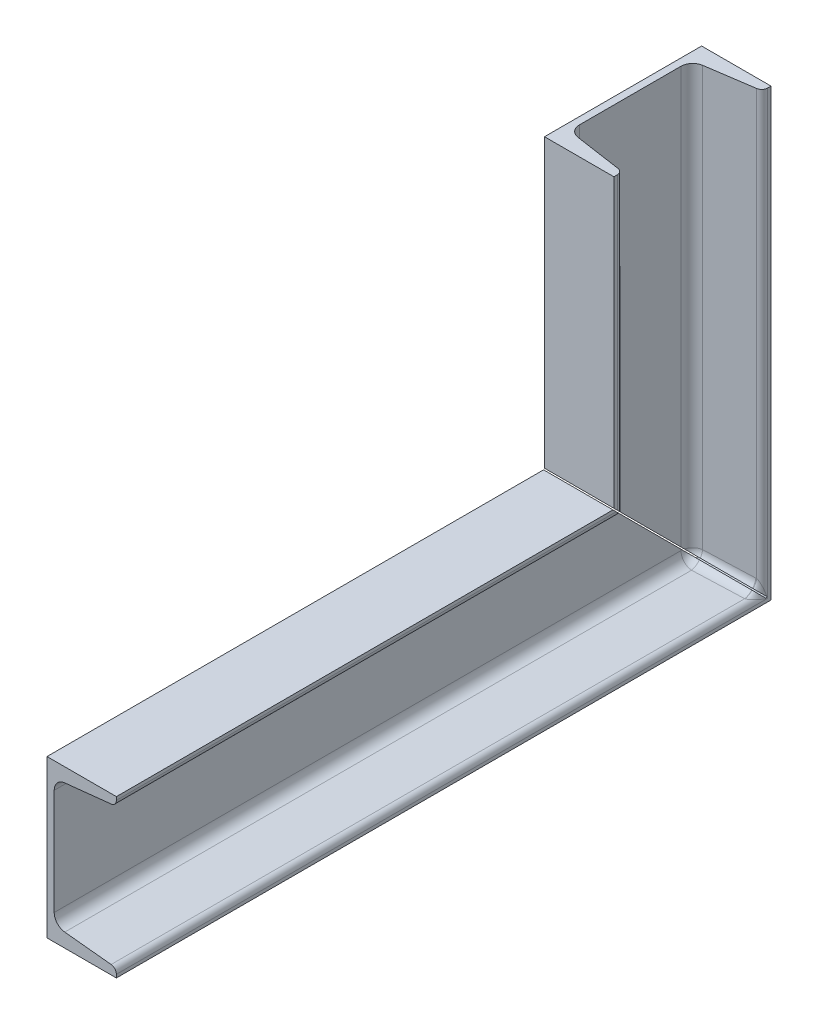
ISO-10303-21;
HEADER;
FILE_DESCRIPTION(('STEP AP214'),'2;1');
FILE_NAME('part.step','',(''),(''),'','','');
FILE_SCHEMA(('AUTOMOTIVE_DESIGN { 1 0 10303 214 1 1 1 1 }'));
ENDSEC;
DATA;
#1=APPLICATION_CONTEXT('core data for automotive mechanical design processes');
#2=APPLICATION_PROTOCOL_DEFINITION('international standard','automotive_design',2000,#1);
#3=PRODUCT_CONTEXT('',#1,'mechanical');
#4=PRODUCT('Part','Part','',(#3));
#5=PRODUCT_RELATED_PRODUCT_CATEGORY('part','',(#4));
#6=PRODUCT_DEFINITION_FORMATION('','',#4);
#7=PRODUCT_DEFINITION_CONTEXT('part definition',#1,'design');
#8=PRODUCT_DEFINITION('design','',#6,#7);
#9=PRODUCT_DEFINITION_SHAPE('','',#8);
#10=(LENGTH_UNIT() NAMED_UNIT(*) SI_UNIT(.MILLI.,.METRE.));
#11=(NAMED_UNIT(*) PLANE_ANGLE_UNIT() SI_UNIT($,.RADIAN.));
#12=(NAMED_UNIT(*) SI_UNIT($,.STERADIAN.) SOLID_ANGLE_UNIT());
#13=UNCERTAINTY_MEASURE_WITH_UNIT(LENGTH_MEASURE(1.E-05),#10,'distance_accuracy_value','');
#14=(GEOMETRIC_REPRESENTATION_CONTEXT(3) GLOBAL_UNCERTAINTY_ASSIGNED_CONTEXT((#13)) GLOBAL_UNIT_ASSIGNED_CONTEXT((#10,
#11,#12)) REPRESENTATION_CONTEXT('',''));
#15=CARTESIAN_POINT('',(0.,0.,0.));
#16=DIRECTION('',(0.,0.,1.));
#17=DIRECTION('',(1.,0.,0.));
#18=AXIS2_PLACEMENT_3D('',#15,#16,#17);
#19=CARTESIAN_POINT('',(52.9999999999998,53.5,500.));
#20=DIRECTION('',(-1.,0.,0.));
#21=DIRECTION('',(0.,0.,1.));
#22=AXIS2_PLACEMENT_3D('',#19,#20,#21);
#23=PLANE('',#22);
#24=DIRECTION('',(0.,0.,-1.));
#25=VECTOR('',#24,1.);
#26=CARTESIAN_POINT('',(52.9999999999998,57.5511778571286,500.));
#27=LINE('',#26,#25);
#28=CARTESIAN_POINT('',(52.9999999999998,57.5511778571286,500.));
#29=VERTEX_POINT('',#28);
#30=CARTESIAN_POINT('',(52.9999999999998,57.5511778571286,118.258284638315));
#31=VERTEX_POINT('',#30);
#32=EDGE_CURVE('E476',#29,#31,#27,.T.);
#33=ORIENTED_EDGE('',*,*,#32,.T.);
#34=DIRECTION('',(0.,0.707106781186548,0.707106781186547));
#35=VECTOR('',#34,1.);
#36=CARTESIAN_POINT('',(52.9999999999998,246.396446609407,307.103553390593));
#37=LINE('',#36,#35);
#38=CARTESIAN_POINT('',(52.9999999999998,60.,120.707106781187));
#39=VERTEX_POINT('',#38);
#40=EDGE_CURVE('E548',#31,#39,#37,.T.);
#41=ORIENTED_EDGE('',*,*,#40,.T.);
#42=DIRECTION('',(0.,0.,-1.));
#43=VECTOR('',#42,1.);
#44=CARTESIAN_POINT('',(52.9999999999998,60.,500.));
#45=LINE('',#44,#43);
#46=CARTESIAN_POINT('',(52.9999999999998,60.,500.));
#47=VERTEX_POINT('',#46);
#48=EDGE_CURVE('E458',#47,#39,#45,.T.);
#49=ORIENTED_EDGE('',*,*,#48,.F.);
#50=DIRECTION('',(0.,1.,0.));
#51=VECTOR('',#50,1.);
#52=CARTESIAN_POINT('',(52.9999999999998,53.5,500.));
#53=LINE('',#52,#51);
#54=EDGE_CURVE('E456',#29,#47,#53,.T.);
#55=ORIENTED_EDGE('',*,*,#54,.F.);
#56=EDGE_LOOP('',(#33,#41,#49,#55));
#57=FACE_BOUND('',#56,.T.);
#58=ADVANCED_FACE('F41',(#57),#23,.F.);
#59=CARTESIAN_POINT('',(5.49999999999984,-48.5,500.));
#60=DIRECTION('',(-1.,0.,0.));
#61=DIRECTION('',(0.,-1.,0.));
#62=AXIS2_PLACEMENT_3D('',#59,#60,#61);
#63=PLANE('',#62);
#64=DIRECTION('',(0.,-1.,0.));
#65=VECTOR('',#64,1.);
#66=CARTESIAN_POINT('',(5.49999999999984,280.,21.2708878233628));
#67=LINE('',#66,#65);
#68=CARTESIAN_POINT('',(5.49999999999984,-39.4362189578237,21.2708878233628));
#69=VERTEX_POINT('',#68);
#70=CARTESIAN_POINT('',(5.49999999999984,-40.3976442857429,21.2708878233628));
#71=VERTEX_POINT('',#70);
#72=EDGE_CURVE('E424',#69,#71,#67,.T.);
#73=ORIENTED_EDGE('',*,*,#72,.F.);
#74=DIRECTION('',(0.,0.707106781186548,0.707106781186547));
#75=VECTOR('',#74,1.);
#76=CARTESIAN_POINT('',(5.49999999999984,195.396446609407,256.103553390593));
#77=LINE('',#76,#75);
#78=CARTESIAN_POINT('',(5.49999999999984,40.3976442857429,101.104751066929));
#79=VERTEX_POINT('',#78);
#80=EDGE_CURVE('E590',#69,#79,#77,.T.);
#81=ORIENTED_EDGE('',*,*,#80,.T.);
#82=DIRECTION('',(0.,0.,-1.));
#83=VECTOR('',#82,1.);
#84=CARTESIAN_POINT('',(5.49999999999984,40.3976442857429,500.));
#85=LINE('',#84,#83);
#86=CARTESIAN_POINT('',(5.49999999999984,40.3976442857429,500.));
#87=VERTEX_POINT('',#86);
#88=EDGE_CURVE('E70',#79,#87,#85,.F.);
#89=ORIENTED_EDGE('',*,*,#88,.T.);
#90=DIRECTION('',(0.,1.,0.));
#91=VECTOR('',#90,1.);
#92=CARTESIAN_POINT('',(5.49999999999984,-48.5,500.));
#93=LINE('',#92,#91);
#94=CARTESIAN_POINT('',(5.49999999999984,-40.3976442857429,500.));
#95=VERTEX_POINT('',#94);
#96=EDGE_CURVE('E451',#95,#87,#93,.T.);
#97=ORIENTED_EDGE('',*,*,#96,.F.);
#98=DIRECTION('',(0.,0.,-1.));
#99=VECTOR('',#98,1.);
#100=CARTESIAN_POINT('',(5.49999999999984,-40.3976442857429,21.2708878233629));
#101=LINE('',#100,#99);
#102=EDGE_CURVE('E511',#95,#71,#101,.T.);
#103=ORIENTED_EDGE('',*,*,#102,.T.);
#104=EDGE_LOOP('',(#73,#81,#89,#97,#103));
#105=FACE_BOUND('',#104,.T.);
#106=ADVANCED_FACE('F589',(#105),#63,.F.);
#107=CARTESIAN_POINT('',(5.49999999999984,48.5,500.));
#108=DIRECTION('',(-0.104684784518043,0.994505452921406,0.));
#109=DIRECTION('',(-0.994505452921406,-0.104684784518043,0.));
#110=AXIS2_PLACEMENT_3D('',#107,#108,#109);
#111=PLANE('',#110);
#112=DIRECTION('',(0.,0.,-1.));
#113=VECTOR('',#112,1.);
#114=CARTESIAN_POINT('',(13.5578369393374,49.3481933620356,21.2708878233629));
#115=LINE('',#114,#113);
#116=CARTESIAN_POINT('',(13.5578369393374,49.3481933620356,500.));
#117=VERTEX_POINT('',#116);
#118=CARTESIAN_POINT('',(13.5578369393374,49.3481933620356,110.055300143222));
#119=VERTEX_POINT('',#118);
#120=EDGE_CURVE('E505',#117,#119,#115,.T.);
#121=ORIENTED_EDGE('',*,*,#120,.T.);
#122=DIRECTION('',(0.989100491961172,0.104115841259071,0.104115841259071));
#123=VECTOR('',#122,1.);
#124=CARTESIAN_POINT('',(45.7442545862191,52.7362373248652,113.443344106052));
#125=LINE('',#124,#123);
#126=CARTESIAN_POINT('',(48.971081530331,53.0759033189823,113.783010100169));
#127=VERTEX_POINT('',#126);
#128=EDGE_CURVE('E534',#119,#127,#125,.T.);
#129=ORIENTED_EDGE('',*,*,#128,.T.);
#130=DIRECTION('',(0.,0.,-1.));
#131=VECTOR('',#130,1.);
#132=CARTESIAN_POINT('',(48.971081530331,53.0759033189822,500.));
#133=LINE('',#132,#131);
#134=CARTESIAN_POINT('',(48.971081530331,53.0759033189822,500.));
#135=VERTEX_POINT('',#134);
#136=EDGE_CURVE('E479',#127,#135,#133,.F.);
#137=ORIENTED_EDGE('',*,*,#136,.T.);
#138=DIRECTION('',(0.994505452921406,0.104684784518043,0.));
#139=VECTOR('',#138,1.);
#140=CARTESIAN_POINT('',(5.49999999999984,48.5,500.));
#141=LINE('',#140,#139);
#142=EDGE_CURVE('E453',#117,#135,#141,.T.);
#143=ORIENTED_EDGE('',*,*,#142,.F.);
#144=EDGE_LOOP('',(#121,#129,#137,#143));
#145=FACE_BOUND('',#144,.T.);
#146=ADVANCED_FACE('F533',(#145),#111,.F.);
#147=CARTESIAN_POINT('',(14.5,280.,21.2708878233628));
#148=DIRECTION('',(0.,-1.,0.));
#149=DIRECTION('',(0.,0.,-1.));
#150=AXIS2_PLACEMENT_3D('',#147,#148,#149);
#151=CYLINDRICAL_SURFACE('',#150,9.);
#152=CARTESIAN_POINT('',(14.4999999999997,-39.4362189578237,21.2708878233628));
#153=DIRECTION('',(0.,-0.707106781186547,0.707106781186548));
#154=DIRECTION('',(0.,-0.707106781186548,-0.707106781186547));
#155=AXIS2_PLACEMENT_3D('',#152,#153,#154);
#156=ELLIPSE('',#155,12.7279220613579,9.);
#157=CARTESIAN_POINT('',(5.55149949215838,-40.3976442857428,20.3094624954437));
#158=VERTEX_POINT('',#157);
#159=EDGE_CURVE('E594',#69,#158,#156,.T.);
#160=ORIENTED_EDGE('',*,*,#159,.F.);
#161=ORIENTED_EDGE('',*,*,#72,.T.);
#162=CARTESIAN_POINT('',(14.4999999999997,-40.3976442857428,21.2708878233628));
#163=DIRECTION('',(0.,-1.,0.));
#164=DIRECTION('',(0.,0.,-1.));
#165=AXIS2_PLACEMENT_3D('',#162,#163,#164);
#166=CIRCLE('',#165,9.);
#167=EDGE_CURVE('E501',#71,#158,#166,.T.);
#168=ORIENTED_EDGE('',*,*,#167,.T.);
#169=EDGE_LOOP('',(#160,#161,#168));
#170=FACE_BOUND('',#169,.T.);
#171=ADVANCED_FACE('F593',(#170),#151,.F.);
#172=CARTESIAN_POINT('',(14.4999999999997,-40.3976442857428,21.2708878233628));
#173=DIRECTION('',(0.,0.,1.));
#174=DIRECTION('',(1.,0.,0.));
#175=AXIS2_PLACEMENT_3D('',#172,#173,#174);
#176=SPHERICAL_SURFACE('',#175,9.);
#177=CARTESIAN_POINT('',(14.4999999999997,-40.3976442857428,21.2708878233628));
#178=DIRECTION('',(-0.983993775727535,0.103578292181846,0.145009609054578));
#179=DIRECTION('',(0.145793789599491,0.,0.989315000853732));
#180=AXIS2_PLACEMENT_3D('',#177,#178,#179);
#181=CIRCLE('',#180,9.);
#182=CARTESIAN_POINT('',(12.9022279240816,-46.1613273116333,14.5457794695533));
#183=VERTEX_POINT('',#182);
#184=CARTESIAN_POINT('',(13.5578369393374,-49.3481933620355,21.2708878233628));
#185=VERTEX_POINT('',#184);
#186=EDGE_CURVE('E358',#183,#185,#181,.T.);
#187=ORIENTED_EDGE('',*,*,#186,.F.);
#188=CARTESIAN_POINT('',(14.4999999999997,-39.9169316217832,20.7901751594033));
#189=DIRECTION('',(0.,-0.707106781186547,0.707106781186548));
#190=DIRECTION('',(0.,-0.707106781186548,-0.707106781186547));
#191=AXIS2_PLACEMENT_3D('',#188,#189,#190);
#192=CIRCLE('',#191,8.97428719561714);
#193=EDGE_CURVE('E582',#183,#158,#192,.F.);
#194=ORIENTED_EDGE('',*,*,#193,.T.);
#195=ORIENTED_EDGE('',*,*,#167,.F.);
#196=CARTESIAN_POINT('',(14.4999999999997,-40.3976442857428,21.2708878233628));
#197=DIRECTION('',(0.,0.,1.));
#198=DIRECTION('',(0.,-1.,0.));
#199=AXIS2_PLACEMENT_3D('',#196,#197,#198);
#200=CIRCLE('',#199,9.);
#201=EDGE_CURVE('E365',#71,#185,#200,.T.);
#202=ORIENTED_EDGE('',*,*,#201,.T.);
#203=EDGE_LOOP('',(#187,#194,#195,#202));
#204=FACE_BOUND('',#203,.T.);
#205=ADVANCED_FACE('F580',(#204),#176,.F.);
#206=CARTESIAN_POINT('',(-15.196382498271,-37.2717092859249,25.6471968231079));
#207=DIRECTION('',(-0.983993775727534,0.103578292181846,0.145009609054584));
#208=DIRECTION('',(0.145793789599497,0.,0.989315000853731));
#209=AXIS2_PLACEMENT_3D('',#206,#207,#208);
#210=CYLINDRICAL_SURFACE('',#209,9.);
#211=CARTESIAN_POINT('',(49.9132445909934,-44.1253542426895,16.0520938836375));
#212=DIRECTION('',(-0.983993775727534,0.103578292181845,0.145009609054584));
#213=DIRECTION('',(0.145793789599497,0.,0.989315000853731));
#214=AXIS2_PLACEMENT_3D('',#211,#212,#213);
#215=CIRCLE('',#214,9.);
#216=CARTESIAN_POINT('',(48.3427395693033,-50.6509041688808,10.0562026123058));
#217=VERTEX_POINT('',#216);
#218=CARTESIAN_POINT('',(48.971081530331,-53.0759033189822,16.0520938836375));
#219=VERTEX_POINT('',#218);
#220=EDGE_CURVE('E359',#217,#219,#215,.T.);
#221=ORIENTED_EDGE('',*,*,#220,.F.);
#222=CARTESIAN_POINT('',(37.3338515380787,-42.8012076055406,17.905899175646));
#223=DIRECTION('',(0.,-0.707106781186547,0.707106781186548));
#224=DIRECTION('',(-0.984416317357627,0.124347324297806,0.124347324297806));
#225=AXIS2_PLACEMENT_3D('',#222,#223,#224);
#226=ELLIPSE('',#225,307.205346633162,9.);
#227=EDGE_CURVE('E577',#217,#183,#226,.F.);
#228=ORIENTED_EDGE('',*,*,#227,.T.);
#229=ORIENTED_EDGE('',*,*,#186,.T.);
#230=DIRECTION('',(-0.983993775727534,0.103578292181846,0.145009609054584));
#231=VECTOR('',#230,1.);
#232=CARTESIAN_POINT('',(-16.1385455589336,-46.2222583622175,25.6471968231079));
#233=LINE('',#232,#231);
#234=EDGE_CURVE('E497',#219,#185,#233,.T.);
#235=ORIENTED_EDGE('',*,*,#234,.F.);
#236=EDGE_LOOP('',(#221,#228,#229,#235));
#237=FACE_BOUND('',#236,.T.);
#238=ADVANCED_FACE('F574',(#237),#210,.F.);
#239=CARTESIAN_POINT('',(52.9999999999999,-57.5511778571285,14.2708878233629));
#240=CARTESIAN_POINT('',(52.9999999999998,-57.5511778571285,6.49999999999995));
#241=CARTESIAN_POINT('',(60.6878558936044,-57.5511778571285,5.3670528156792));
#242=CARTESIAN_POINT('',(52.9999999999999,-57.3548165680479,14.2708878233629));
#243=CARTESIAN_POINT('',(52.9999999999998,-57.304846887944,6.49999999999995));
#244=CARTESIAN_POINT('',(60.6878558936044,-56.9620939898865,5.3670528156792));
#245=CARTESIAN_POINT('',(52.9871273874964,-57.1584552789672,14.2765788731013));
#246=CARTESIAN_POINT('',(52.9805405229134,-57.0584262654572,6.50286771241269));
#247=CARTESIAN_POINT('',(60.6492380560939,-56.3730101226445,5.37274386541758));
#248=CARTESIAN_POINT('',(52.9358669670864,-56.7690933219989,14.2992413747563));
#249=CARTESIAN_POINT('',(52.9033573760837,-56.5722099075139,6.51424207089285));
#250=CARTESIAN_POINT('',(60.4954567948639,-55.2049242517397,5.39540636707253));
#251=CARTESIAN_POINT('',(52.8974698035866,-56.5760939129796,14.3162169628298));
#252=CARTESIAN_POINT('',(52.8455639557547,-56.3322456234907,6.52275899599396));
#253=CARTESIAN_POINT('',(60.3802653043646,-54.6259260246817,5.41238195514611));
#254=CARTESIAN_POINT('',(52.7958266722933,-56.1967561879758,14.3611539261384));
#255=CARTESIAN_POINT('',(52.6935113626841,-55.8651512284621,6.54516674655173));
#256=CARTESIAN_POINT('',(60.0753359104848,-53.4879128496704,5.45731891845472));
#257=CARTESIAN_POINT('',(52.7325631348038,-56.0104226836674,14.3891230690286));
#258=CARTESIAN_POINT('',(52.599119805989,-55.637883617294,6.5590770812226));
#259=CARTESIAN_POINT('',(59.885545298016,-52.928912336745,5.48528806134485));
#260=CARTESIAN_POINT('',(52.582277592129,-55.6476009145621,14.4555650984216));
#261=CARTESIAN_POINT('',(52.3767493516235,-55.2019488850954,6.5918474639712));
#262=CARTESIAN_POINT('',(59.4346886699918,-51.8404470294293,5.55173009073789));
#263=CARTESIAN_POINT('',(52.4952319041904,-55.471122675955,14.4940484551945));
#264=CARTESIAN_POINT('',(52.2485888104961,-54.993192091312,6.61073428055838));
#265=CARTESIAN_POINT('',(59.1735516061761,-51.3110123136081,5.59021344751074));
#266=CARTESIAN_POINT('',(52.2988768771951,-55.1310254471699,14.5808580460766));
#267=CARTESIAN_POINT('',(51.9625391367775,-54.5994092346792,6.65288896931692));
#268=CARTESIAN_POINT('',(58.58448652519,-50.2907206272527,5.6770230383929));
#269=CARTESIAN_POINT('',(52.1895404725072,-54.9674224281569,14.6291962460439));
#270=CARTESIAN_POINT('',(51.8044371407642,-54.4143527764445,6.67618821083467));
#271=CARTESIAN_POINT('',(58.2564773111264,-49.7999115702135,5.72536123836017));
#272=CARTESIAN_POINT('',(51.9504772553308,-54.6558688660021,14.734887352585));
#273=CARTESIAN_POINT('',(51.4632098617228,-54.0722906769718,6.72647433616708));
#274=CARTESIAN_POINT('',(57.5392876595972,-48.8652508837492,5.83105234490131));
#275=CARTESIAN_POINT('',(51.8207229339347,-54.5079398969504,14.7922524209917));
#276=CARTESIAN_POINT('',(51.279861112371,-53.9153189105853,6.75349415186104));
#277=CARTESIAN_POINT('',(57.1500246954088,-48.4214639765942,5.88841741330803));
#278=CARTESIAN_POINT('',(51.5430434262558,-54.2302601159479,14.9150159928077));
#279=CARTESIAN_POINT('',(50.8935264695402,-53.632786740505,6.81042767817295));
#280=CARTESIAN_POINT('',(56.3169861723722,-47.5884246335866,6.01118098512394));
#281=CARTESIAN_POINT('',(51.3950929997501,-54.1005351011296,14.9804256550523));
#282=CARTESIAN_POINT('',(50.6903274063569,-53.5073226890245,6.84037280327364));
#283=CARTESIAN_POINT('',(55.8731348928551,-47.1992495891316,6.07659064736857));
#284=CARTESIAN_POINT('',(51.083549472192,-53.861479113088,15.1181606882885));
#285=CARTESIAN_POINT('',(50.2701643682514,-53.2900882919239,6.90229156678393));
#286=CARTESIAN_POINT('',(54.9385043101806,-46.4820816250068,6.21432568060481));
#287=CARTESIAN_POINT('',(50.9199354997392,-53.7521759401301,15.190495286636));
#288=CARTESIAN_POINT('',(50.053016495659,-53.1984686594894,6.93429230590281));
#289=CARTESIAN_POINT('',(54.4476623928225,-46.1541721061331,6.28666027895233));
#290=CARTESIAN_POINT('',(50.579859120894,-53.5558325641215,15.3408448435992));
#291=CARTESIAN_POINT('',(49.6110943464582,-53.0500457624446,6.99941767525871));
#292=CARTESIAN_POINT('',(53.4274332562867,-45.5651419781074,6.4370098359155));
#293=CARTESIAN_POINT('',(50.4033814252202,-53.4688194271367,15.4188665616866));
#294=CARTESIAN_POINT('',(49.3861806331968,-52.9934342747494,7.03256285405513));
#295=CARTESIAN_POINT('',(52.8980001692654,-45.3041025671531,6.51503155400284));
#296=CARTESIAN_POINT('',(50.0405909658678,-53.3185465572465,15.5792581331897));
#297=CARTESIAN_POINT('',(48.9348922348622,-52.914953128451,7.09906851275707));
#298=CARTESIAN_POINT('',(51.8096287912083,-44.8532839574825,6.67542312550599));
#299=CARTESIAN_POINT('',(49.8542686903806,-53.2553102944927,15.6616321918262));
#300=CARTESIAN_POINT('',(48.7084326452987,-52.8932994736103,7.13244150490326));
#301=CARTESIAN_POINT('',(51.2506619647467,-44.6635751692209,6.75779718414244));
#302=CARTESIAN_POINT('',(49.4749709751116,-53.1536776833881,15.8293217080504));
#303=CARTESIAN_POINT('',(48.2599936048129,-52.8834754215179,7.19852725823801));
#304=CARTESIAN_POINT('',(50.1127688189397,-44.3586773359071,6.92548670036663));
#305=CARTESIAN_POINT('',(49.281991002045,-53.1152986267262,15.9146391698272));
#306=CARTESIAN_POINT('',(48.037988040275,-52.8955267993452,7.23124386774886));
#307=CARTESIAN_POINT('',(49.5338288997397,-44.2435401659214,7.01080416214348));
#308=CARTESIAN_POINT('',(48.8926748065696,-53.0640441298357,16.0867579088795));
#309=CARTESIAN_POINT('',(47.6039209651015,-52.9507400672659,7.29521164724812));
#310=CARTESIAN_POINT('',(48.3658803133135,-44.08977667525,7.18292290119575));
#311=CARTESIAN_POINT('',(48.6963374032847,-53.0511778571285,16.1735597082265));
#312=CARTESIAN_POINT('',(47.3918905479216,-52.9941114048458,7.32645823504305));
#313=CARTESIAN_POINT('',(47.7768681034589,-44.0511778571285,7.26972470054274));
#314=CARTESIAN_POINT('',(48.303662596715,-53.0511778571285,16.3471633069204));
#315=CARTESIAN_POINT('',(46.9825192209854,-53.108608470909,7.38678664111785));
#316=CARTESIAN_POINT('',(46.5988436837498,-44.0511778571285,7.44332829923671));
#317=CARTESIAN_POINT('',(48.1073251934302,-53.0640441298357,16.4339651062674));
#318=CARTESIAN_POINT('',(46.7852597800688,-53.1799153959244,7.41585645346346));
#319=CARTESIAN_POINT('',(46.0098314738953,-44.08977667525,7.5301300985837));
#320=CARTESIAN_POINT('',(47.7180089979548,-53.1152986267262,16.6060838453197));
#321=CARTESIAN_POINT('',(46.4092439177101,-53.3461369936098,7.47126931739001));
#322=CARTESIAN_POINT('',(44.8418828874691,-44.2435401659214,7.70224883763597));
#323=CARTESIAN_POINT('',(47.5250290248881,-53.1536776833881,16.6914013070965));
#324=CARTESIAN_POINT('',(46.230608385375,-53.4411923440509,7.49759455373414));
#325=CARTESIAN_POINT('',(44.2629429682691,-44.3586773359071,7.78756629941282));
#326=CARTESIAN_POINT('',(47.1457313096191,-53.2553102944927,16.8590908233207));
#327=CARTESIAN_POINT('',(45.8945547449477,-53.6502249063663,7.54711824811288));
#328=CARTESIAN_POINT('',(43.1250498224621,-44.6635751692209,7.95525581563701));
#329=CARTESIAN_POINT('',(46.9594090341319,-53.3185465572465,16.9414648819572));
#330=CARTESIAN_POINT('',(45.7372833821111,-53.764294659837,7.57029508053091));
#331=CARTESIAN_POINT('',(42.5660829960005,-44.8532839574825,8.03762987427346));
#332=CARTESIAN_POINT('',(46.5966185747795,-53.4688194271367,17.1018564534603));
#333=CARTESIAN_POINT('',(45.445472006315,-54.0064305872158,7.61329886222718));
#334=CARTESIAN_POINT('',(41.4777116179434,-45.3041025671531,8.19802144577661));
#335=CARTESIAN_POINT('',(46.4201408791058,-53.5558325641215,17.1798781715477));
#336=CARTESIAN_POINT('',(45.3110901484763,-54.134538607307,7.63310250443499));
#337=CARTESIAN_POINT('',(40.9482785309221,-45.5651419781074,8.27604316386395));
#338=CARTESIAN_POINT('',(46.0800645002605,-53.7521759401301,17.3302277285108));
#339=CARTESIAN_POINT('',(45.0653537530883,-54.3999165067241,7.66931628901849));
#340=CARTESIAN_POINT('',(39.9280493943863,-46.1541721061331,8.42639272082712));
#341=CARTESIAN_POINT('',(45.9164505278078,-53.861479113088,17.4025623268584));
#342=CARTESIAN_POINT('',(44.9541551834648,-54.5371798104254,7.68570344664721));
#343=CARTESIAN_POINT('',(39.4372074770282,-46.4820816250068,8.49872731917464));
#344=CARTESIAN_POINT('',(45.6049070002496,-54.1005351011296,17.5402973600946));
#345=CARTESIAN_POINT('',(44.7539432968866,-54.8164601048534,7.7152083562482));
#346=CARTESIAN_POINT('',(38.5025768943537,-47.1992495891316,8.63646235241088));
#347=CARTESIAN_POINT('',(45.4569565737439,-54.2302601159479,17.6057070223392));
#348=CARTESIAN_POINT('',(44.6650725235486,-54.9584283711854,7.72830510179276));
#349=CARTESIAN_POINT('',(38.0587256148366,-47.5884246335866,8.70187201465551));
#350=CARTESIAN_POINT('',(45.1792770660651,-54.5079398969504,17.7284705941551));
#351=CARTESIAN_POINT('',(44.5077185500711,-55.2434448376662,7.75149410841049));
#352=CARTESIAN_POINT('',(37.2256870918,-48.4214639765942,8.82463558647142));
#353=CARTESIAN_POINT('',(45.0495227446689,-54.6558688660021,17.7858356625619));
#354=CARTESIAN_POINT('',(44.439356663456,-55.3864111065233,7.76156849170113));
#355=CARTESIAN_POINT('',(36.8364241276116,-48.8652508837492,8.88200065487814));
#356=CARTESIAN_POINT('',(44.8104595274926,-54.9674224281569,17.891526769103));
#357=CARTESIAN_POINT('',(44.3205452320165,-55.6707284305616,7.77907754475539));
#358=CARTESIAN_POINT('',(36.1192344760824,-49.7999115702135,8.98769176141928));
#359=CARTESIAN_POINT('',(44.7011231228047,-55.1310254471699,17.9398649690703));
#360=CARTESIAN_POINT('',(44.2701918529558,-55.8119743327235,7.78649804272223));
#361=CARTESIAN_POINT('',(35.7912252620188,-50.2907206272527,9.03602996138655));
#362=CARTESIAN_POINT('',(44.5047680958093,-55.4711226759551,18.0266745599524));
#363=CARTESIAN_POINT('',(44.1845970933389,-56.091279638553,7.79911200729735));
#364=CARTESIAN_POINT('',(35.2021601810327,-51.3110123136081,9.12283955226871));
#365=CARTESIAN_POINT('',(44.4177224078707,-55.6476009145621,18.0651579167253));
#366=CARTESIAN_POINT('',(44.1494264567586,-56.2292200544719,7.8042950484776));
#367=CARTESIAN_POINT('',(34.941023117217,-51.8404470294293,9.16132290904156));
#368=CARTESIAN_POINT('',(44.267436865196,-56.0104226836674,18.1315999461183));
#369=CARTESIAN_POINT('',(44.0914629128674,-56.5014860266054,7.81283704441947));
#370=CARTESIAN_POINT('',(34.4901664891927,-52.928912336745,9.2277649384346));
#371=CARTESIAN_POINT('',(44.2041733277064,-56.1967561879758,18.1595690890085));
#372=CARTESIAN_POINT('',(44.0687177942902,-56.6356862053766,7.81618895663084));
#373=CARTESIAN_POINT('',(34.300375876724,-53.4879128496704,9.25573408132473));
#374=CARTESIAN_POINT('',(44.1025301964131,-56.5760939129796,18.2045060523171));
#375=CARTESIAN_POINT('',(44.0333202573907,-56.9010663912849,7.82140543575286));
#376=CARTESIAN_POINT('',(33.9954464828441,-54.6259260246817,9.30067104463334));
#377=CARTESIAN_POINT('',(44.0641330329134,-56.7690933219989,18.2214816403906));
#378=CARTESIAN_POINT('',(44.0206965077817,-57.0321193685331,7.82326577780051));
#379=CARTESIAN_POINT('',(33.8802549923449,-55.2049242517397,9.31764663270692));
#380=CARTESIAN_POINT('',(44.0128726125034,-57.1584552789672,18.2441441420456));
#381=CARTESIAN_POINT('',(44.0040297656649,-57.292570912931,7.82572192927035));
#382=CARTESIAN_POINT('',(33.7264737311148,-56.3730101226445,9.34030913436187));
#383=CARTESIAN_POINT('',(43.9999999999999,-57.3548165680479,18.249835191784));
#384=CARTESIAN_POINT('',(44.,-57.4218428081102,7.82631578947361));
#385=CARTESIAN_POINT('',(33.6878558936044,-56.9620939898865,9.34600018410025));
#386=CARTESIAN_POINT('',(43.9999999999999,-57.7475391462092,18.249835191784));
#387=CARTESIAN_POINT('',(44.,-57.6805129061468,7.82631578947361));
#388=CARTESIAN_POINT('',(33.6878558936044,-58.1402617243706,9.34600018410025));
#389=CARTESIAN_POINT('',(44.0128726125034,-57.9439004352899,18.2441441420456));
#390=CARTESIAN_POINT('',(44.0040297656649,-57.8097848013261,7.82572192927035));
#391=CARTESIAN_POINT('',(33.7264737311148,-58.7293455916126,9.34030913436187));
#392=CARTESIAN_POINT('',(44.0641330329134,-58.3332623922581,18.2214816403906));
#393=CARTESIAN_POINT('',(44.0206965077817,-58.070236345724,7.82326577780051));
#394=CARTESIAN_POINT('',(33.8802549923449,-59.8974314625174,9.31764663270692));
#395=CARTESIAN_POINT('',(44.1025301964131,-58.5262618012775,18.2045060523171));
#396=CARTESIAN_POINT('',(44.0333202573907,-58.2012893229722,7.82140543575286));
#397=CARTESIAN_POINT('',(33.9954464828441,-60.4764296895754,9.30067104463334));
#398=CARTESIAN_POINT('',(44.2041733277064,-58.9055995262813,18.1595690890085));
#399=CARTESIAN_POINT('',(44.0687177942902,-58.4666695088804,7.81618895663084));
#400=CARTESIAN_POINT('',(34.300375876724,-61.6144428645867,9.25573408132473));
#401=CARTESIAN_POINT('',(44.267436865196,-59.0919330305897,18.1315999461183));
#402=CARTESIAN_POINT('',(44.0914629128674,-58.6008696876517,7.81283704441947));
#403=CARTESIAN_POINT('',(34.4901664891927,-62.1734433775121,9.2277649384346));
#404=CARTESIAN_POINT('',(44.4177224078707,-59.4547547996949,18.0651579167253));
#405=CARTESIAN_POINT('',(44.1494264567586,-58.8731356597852,7.8042950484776));
#406=CARTESIAN_POINT('',(34.941023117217,-63.2619086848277,9.16132290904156));
#407=CARTESIAN_POINT('',(44.5047680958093,-59.631233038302,18.0266745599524));
#408=CARTESIAN_POINT('',(44.1845970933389,-59.0110760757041,7.79911200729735));
#409=CARTESIAN_POINT('',(35.2021601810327,-63.791343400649,9.12283955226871));
#410=CARTESIAN_POINT('',(44.7011231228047,-59.9713302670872,17.9398649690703));
#411=CARTESIAN_POINT('',(44.2701918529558,-59.2903813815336,7.78649804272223));
#412=CARTESIAN_POINT('',(35.7912252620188,-64.8116350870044,9.03602996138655));
#413=CARTESIAN_POINT('',(44.8104595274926,-60.1349332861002,17.891526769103));
#414=CARTESIAN_POINT('',(44.3205452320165,-59.4316272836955,7.77907754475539));
#415=CARTESIAN_POINT('',(36.1192344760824,-65.3024441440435,8.98769176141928));
#416=CARTESIAN_POINT('',(45.0495227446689,-60.446486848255,17.7858356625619));
#417=CARTESIAN_POINT('',(44.439356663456,-59.7159446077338,7.76156849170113));
#418=CARTESIAN_POINT('',(36.8364241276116,-66.2371048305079,8.88200065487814));
#419=CARTESIAN_POINT('',(45.1792770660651,-60.5944158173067,17.7284705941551));
#420=CARTESIAN_POINT('',(44.5077185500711,-59.8589108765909,7.75149410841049));
#421=CARTESIAN_POINT('',(37.2256870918,-66.6808917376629,8.82463558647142));
#422=CARTESIAN_POINT('',(45.4569565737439,-60.8720955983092,17.6057070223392));
#423=CARTESIAN_POINT('',(44.6650725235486,-60.1439273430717,7.72830510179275));
#424=CARTESIAN_POINT('',(38.0587256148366,-67.5139310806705,8.70187201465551));
#425=CARTESIAN_POINT('',(45.6049070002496,-61.0018206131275,17.5402973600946));
#426=CARTESIAN_POINT('',(44.7539432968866,-60.2858956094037,7.7152083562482));
#427=CARTESIAN_POINT('',(38.5025768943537,-67.9031061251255,8.63646235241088));
#428=CARTESIAN_POINT('',(45.9164505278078,-61.2408766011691,17.4025623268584));
#429=CARTESIAN_POINT('',(44.9541551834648,-60.5651759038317,7.68570344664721));
#430=CARTESIAN_POINT('',(39.4372074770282,-68.6202740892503,8.49872731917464));
#431=CARTESIAN_POINT('',(46.0800645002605,-61.350179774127,17.3302277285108));
#432=CARTESIAN_POINT('',(45.0653537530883,-60.702439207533,7.66931628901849));
#433=CARTESIAN_POINT('',(39.9280493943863,-68.948183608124,8.42639272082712));
#434=CARTESIAN_POINT('',(46.4201408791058,-61.5465231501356,17.1798781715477));
#435=CARTESIAN_POINT('',(45.3110901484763,-60.9678171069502,7.63310250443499));
#436=CARTESIAN_POINT('',(40.9482785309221,-69.5372137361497,8.27604316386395));
#437=CARTESIAN_POINT('',(46.5966185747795,-61.6335362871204,17.1018564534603));
#438=CARTESIAN_POINT('',(45.445472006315,-61.0959251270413,7.61329886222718));
#439=CARTESIAN_POINT('',(41.4777116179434,-69.798253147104,8.19802144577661));
#440=CARTESIAN_POINT('',(46.9594090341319,-61.7838091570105,16.9414648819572));
#441=CARTESIAN_POINT('',(45.7372833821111,-61.3380610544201,7.57029508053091));
#442=CARTESIAN_POINT('',(42.5660829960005,-70.2490717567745,8.03762987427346));
#443=CARTESIAN_POINT('',(47.1457313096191,-61.8470454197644,16.8590908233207));
#444=CARTESIAN_POINT('',(45.8945547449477,-61.4521308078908,7.54711824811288));
#445=CARTESIAN_POINT('',(43.1250498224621,-70.4387805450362,7.95525581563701));
#446=CARTESIAN_POINT('',(47.5250290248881,-61.948678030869,16.6914013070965));
#447=CARTESIAN_POINT('',(46.230608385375,-61.6611633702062,7.49759455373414));
#448=CARTESIAN_POINT('',(44.2629429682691,-70.74367837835,7.78756629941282));
#449=CARTESIAN_POINT('',(47.7180089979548,-61.9870570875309,16.6060838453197));
#450=CARTESIAN_POINT('',(46.4092439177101,-61.7562187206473,7.47126931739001));
#451=CARTESIAN_POINT('',(44.8418828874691,-70.8588155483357,7.70224883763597));
#452=CARTESIAN_POINT('',(48.1073251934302,-62.0383115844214,16.4339651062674));
#453=CARTESIAN_POINT('',(46.7852597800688,-61.9224403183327,7.41585645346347));
#454=CARTESIAN_POINT('',(46.0098314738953,-71.0125790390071,7.5301300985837));
#455=CARTESIAN_POINT('',(48.303662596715,-62.0511778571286,16.3471633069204));
#456=CARTESIAN_POINT('',(46.9825192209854,-61.9937472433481,7.38678664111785));
#457=CARTESIAN_POINT('',(46.5988436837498,-71.0511778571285,7.44332829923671));
#458=CARTESIAN_POINT('',(48.6963374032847,-62.0511778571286,16.1735597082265));
#459=CARTESIAN_POINT('',(47.3918905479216,-62.1082443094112,7.32645823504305));
#460=CARTESIAN_POINT('',(47.7768681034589,-71.0511778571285,7.26972470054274));
#461=CARTESIAN_POINT('',(48.8926748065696,-62.0383115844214,16.0867579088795));
#462=CARTESIAN_POINT('',(47.6039209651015,-62.1516156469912,7.29521164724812));
#463=CARTESIAN_POINT('',(48.3658803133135,-71.0125790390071,7.18292290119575));
#464=CARTESIAN_POINT('',(49.281991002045,-61.9870570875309,15.9146391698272));
#465=CARTESIAN_POINT('',(48.037988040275,-62.2068289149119,7.23124386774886));
#466=CARTESIAN_POINT('',(49.5338288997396,-70.8588155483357,7.01080416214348));
#467=CARTESIAN_POINT('',(49.4749709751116,-61.948678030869,15.8293217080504));
#468=CARTESIAN_POINT('',(48.2599936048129,-62.2188802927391,7.19852725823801));
#469=CARTESIAN_POINT('',(50.1127688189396,-70.74367837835,6.92548670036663));
#470=CARTESIAN_POINT('',(49.8542686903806,-61.8470454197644,15.6616321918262));
#471=CARTESIAN_POINT('',(48.7084326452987,-62.2090562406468,7.13244150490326));
#472=CARTESIAN_POINT('',(51.2506619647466,-70.4387805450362,6.75779718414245));
#473=CARTESIAN_POINT('',(50.0405909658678,-61.7838091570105,15.5792581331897));
#474=CARTESIAN_POINT('',(48.9348922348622,-62.1874025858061,7.09906851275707));
#475=CARTESIAN_POINT('',(51.8096287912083,-70.2490717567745,6.675423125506));
#476=CARTESIAN_POINT('',(50.4033814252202,-61.6335362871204,15.4188665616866));
#477=CARTESIAN_POINT('',(49.3861806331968,-62.1089214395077,7.03256285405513));
#478=CARTESIAN_POINT('',(52.8980001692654,-69.798253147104,6.51503155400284));
#479=CARTESIAN_POINT('',(50.579859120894,-61.5465231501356,15.3408448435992));
#480=CARTESIAN_POINT('',(49.6110943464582,-62.0523099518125,6.99941767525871));
#481=CARTESIAN_POINT('',(53.4274332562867,-69.5372137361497,6.4370098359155));
#482=CARTESIAN_POINT('',(50.9199354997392,-61.350179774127,15.1904952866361));
#483=CARTESIAN_POINT('',(50.0530164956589,-61.9038870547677,6.93429230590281));
#484=CARTESIAN_POINT('',(54.4476623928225,-68.948183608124,6.28666027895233));
#485=CARTESIAN_POINT('',(51.083549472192,-61.2408766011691,15.1181606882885));
#486=CARTESIAN_POINT('',(50.2701643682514,-61.8122674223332,6.90229156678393));
#487=CARTESIAN_POINT('',(54.9385043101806,-68.6202740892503,6.21432568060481));
#488=CARTESIAN_POINT('',(51.3950929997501,-61.0018206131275,14.9804256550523));
#489=CARTESIAN_POINT('',(50.6903274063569,-61.5950330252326,6.84037280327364));
#490=CARTESIAN_POINT('',(55.8731348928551,-67.9031061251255,6.07659064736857));
#491=CARTESIAN_POINT('',(51.5430434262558,-60.8720955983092,14.9150159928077));
#492=CARTESIAN_POINT('',(50.8935264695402,-61.4695689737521,6.81042767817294));
#493=CARTESIAN_POINT('',(56.3169861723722,-67.5139310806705,6.01118098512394));
#494=CARTESIAN_POINT('',(51.8207229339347,-60.5944158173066,14.7922524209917));
#495=CARTESIAN_POINT('',(51.279861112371,-61.1870368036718,6.75349415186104));
#496=CARTESIAN_POINT('',(57.1500246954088,-66.6808917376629,5.88841741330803));
#497=CARTESIAN_POINT('',(51.9504772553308,-60.446486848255,14.734887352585));
#498=CARTESIAN_POINT('',(51.4632098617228,-61.0300650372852,6.72647433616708));
#499=CARTESIAN_POINT('',(57.5392876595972,-66.2371048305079,5.83105234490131));
#500=CARTESIAN_POINT('',(52.1895404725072,-60.1349332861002,14.6291962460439));
#501=CARTESIAN_POINT('',(51.8044371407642,-60.6880029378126,6.67618821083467));
#502=CARTESIAN_POINT('',(58.2564773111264,-65.3024441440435,5.72536123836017));
#503=CARTESIAN_POINT('',(52.2988768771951,-59.9713302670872,14.5808580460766));
#504=CARTESIAN_POINT('',(51.9625391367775,-60.5029464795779,6.65288896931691));
#505=CARTESIAN_POINT('',(58.58448652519,-64.8116350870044,5.6770230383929));
#506=CARTESIAN_POINT('',(52.4952319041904,-59.631233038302,14.4940484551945));
#507=CARTESIAN_POINT('',(52.2485888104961,-60.1091636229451,6.61073428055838));
#508=CARTESIAN_POINT('',(59.1735516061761,-63.791343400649,5.59021344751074));
#509=CARTESIAN_POINT('',(52.582277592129,-59.4547547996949,14.4555650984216));
#510=CARTESIAN_POINT('',(52.3767493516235,-59.9004068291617,6.5918474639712));
#511=CARTESIAN_POINT('',(59.4346886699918,-63.2619086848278,5.55173009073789));
#512=CARTESIAN_POINT('',(52.7325631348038,-59.0919330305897,14.3891230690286));
#513=CARTESIAN_POINT('',(52.599119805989,-59.464472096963,6.55907708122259));
#514=CARTESIAN_POINT('',(59.885545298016,-62.1734433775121,5.48528806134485));
#515=CARTESIAN_POINT('',(52.7958266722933,-58.9055995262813,14.3611539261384));
#516=CARTESIAN_POINT('',(52.6935113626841,-59.237204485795,6.54516674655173));
#517=CARTESIAN_POINT('',(60.0753359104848,-61.6144428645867,5.45731891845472));
#518=CARTESIAN_POINT('',(52.8974698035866,-58.5262618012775,14.3162169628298));
#519=CARTESIAN_POINT('',(52.8455639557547,-58.7701100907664,6.52275899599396));
#520=CARTESIAN_POINT('',(60.3802653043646,-60.4764296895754,5.41238195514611));
#521=CARTESIAN_POINT('',(52.9358669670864,-58.3332623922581,14.2992413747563));
#522=CARTESIAN_POINT('',(52.9033573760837,-58.5301458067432,6.51424207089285));
#523=CARTESIAN_POINT('',(60.4954567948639,-59.8974314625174,5.39540636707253));
#524=CARTESIAN_POINT('',(52.9871273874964,-57.9439004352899,14.2765788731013));
#525=CARTESIAN_POINT('',(52.9805405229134,-58.0439294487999,6.50286771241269));
#526=CARTESIAN_POINT('',(60.6492380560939,-58.7293455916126,5.37274386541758));
#527=CARTESIAN_POINT('',(52.9999999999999,-57.7475391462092,14.2708878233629));
#528=CARTESIAN_POINT('',(52.9999999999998,-57.7975088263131,6.49999999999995));
#529=CARTESIAN_POINT('',(60.6878558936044,-58.1402617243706,5.3670528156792));
#530=CARTESIAN_POINT('',(52.9999999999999,-57.5511778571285,14.2708878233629));
#531=CARTESIAN_POINT('',(52.9999999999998,-57.5511778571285,6.49999999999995));
#532=CARTESIAN_POINT('',(60.6878558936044,-57.5511778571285,5.3670528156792));
#533=(BOUNDED_SURFACE() B_SPLINE_SURFACE(3,2,((#239,#240,#241),(#242,#243,#244),(#245,#246,
#247),(#248,#249,#250),(#251,#252,#253),(#254,#255,#256),(#257,#258,#259),(#260,#261,#262),
(#263,#264,#265),(#266,#267,#268),(#269,#270,#271),(#272,#273,#274),(#275,#276,#277),(#278,#279,
#280),(#281,#282,#283),(#284,#285,#286),(#287,#288,#289),(#290,#291,#292),(#293,#294,#295),
(#296,#297,#298),(#299,#300,#301),(#302,#303,#304),(#305,#306,#307),(#308,#309,#310),(#311,#312,
#313),(#314,#315,#316),(#317,#318,#319),(#320,#321,#322),(#323,#324,#325),(#326,#327,#328),
(#329,#330,#331),(#332,#333,#334),(#335,#336,#337),(#338,#339,#340),(#341,#342,#343),(#344,#345,
#346),(#347,#348,#349),(#350,#351,#352),(#353,#354,#355),(#356,#357,#358),(#359,#360,#361),
(#362,#363,#364),(#365,#366,#367),(#368,#369,#370),(#371,#372,#373),(#374,#375,#376),(#377,#378,
#379),(#380,#381,#382),(#383,#384,#385),(#386,#387,#388),(#389,#390,#391),(#392,#393,#394),
(#395,#396,#397),(#398,#399,#400),(#401,#402,#403),(#404,#405,#406),(#407,#408,#409),(#410,#411,
#412),(#413,#414,#415),(#416,#417,#418),(#419,#420,#421),(#422,#423,#424),(#425,#426,#427),
(#428,#429,#430),(#431,#432,#433),(#434,#435,#436),(#437,#438,#439),(#440,#441,#442),(#443,#444,
#445),(#446,#447,#448),(#449,#450,#451),(#452,#453,#454),(#455,#456,#457),(#458,#459,#460),
(#461,#462,#463),(#464,#465,#466),(#467,#468,#469),(#470,#471,#472),(#473,#474,#475),(#476,#477,
#478),(#479,#480,#481),(#482,#483,#484),(#485,#486,#487),(#488,#489,#490),(#491,#492,#493),
(#494,#495,#496),(#497,#498,#499),(#500,#501,#502),(#503,#504,#505),(#506,#507,#508),(#509,#510,
#511),(#512,#513,#514),(#515,#516,#517),(#518,#519,#520),(#521,#522,#523),(#524,#525,#526),
(#527,#528,#529),(#530,#531,#532)),.UNSPECIFIED.,.T.,.F.,.F.) B_SPLINE_SURFACE_WITH_KNOTS((4,2,
2,2,2,2,2,2,2,2,2,2,2,2,2,2,2,2,2,2,2,2,2,2,2,2,2,2,2,2,2,2,2,2,2,2,2,2,2,2,2,2,2,2,2,2,2,2,4),
(3,3),(0.,1.76596651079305,3.53258066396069,5.30044529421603,7.07007685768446,8.84187006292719,
10.6160711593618,12.3927616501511,14.1718534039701,15.9530953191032,17.7360909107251,
19.5203254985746,21.3052011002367,23.0900767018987,24.8743112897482,26.6573068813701,
28.4385487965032,30.2176405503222,31.9943310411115,33.7685321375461,35.5403253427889,
37.3099569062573,39.0778215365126,40.8444356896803,42.6104022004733,44.3763687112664,
46.142982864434,47.9108474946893,49.6804790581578,51.4522722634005,53.2264733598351,
55.0031638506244,56.7822556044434,58.5634975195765,60.3464931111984,62.130727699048,
63.91560330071,65.700478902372,67.4847134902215,69.2677090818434,71.0489509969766,
72.8280427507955,74.6047332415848,76.3789343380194,78.1507275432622,79.9203591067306,
81.6882237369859,83.4548378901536,85.2208044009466),(0.,1.),
.UNSPECIFIED.) GEOMETRIC_REPRESENTATION_ITEM() RATIONAL_B_SPLINE_SURFACE(((1.,0.756899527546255,
1.),(1.,0.756899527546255,1.),(1.,0.756761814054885,1.),(1.,0.756212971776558,1.),(1.,
0.755801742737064,1.),(1.,0.754711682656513,1.),(1.,0.754032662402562,1.),(1.,0.752416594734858,
1.),(1.,0.751479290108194,1.),(1.,0.749359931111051,1.),(1.,0.74817757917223,1.),(1.,
0.745585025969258,1.),(1.,0.744174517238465,1.),(1.,0.741146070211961,1.),(1.,0.739527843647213,
1.),(1.,0.736107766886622,1.),(1.,0.734305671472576,1.),(1.,0.730544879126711,1.),(1.,
0.728585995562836,1.),(1.,0.724541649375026,1.),(1.,0.722456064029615,1.),(1.,0.718191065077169,
1.),(1.,0.716011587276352,1.),(1.,0.711593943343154,1.),(1.,0.709355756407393,1.),(1.,
0.704857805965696,1.),(1.,0.702598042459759,1.),(1.,0.698095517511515,1.),(1.,0.69585275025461,
1.),(1.,0.691423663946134,1.),(1.,0.689237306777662,1.),(1.,0.684960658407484,1.),(1.,
0.682870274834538,1.),(1.,0.678824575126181,1.),(1.,0.676869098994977,1.),(1.,0.673130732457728,
1.),(1.,0.671347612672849,1.),(1.,0.667989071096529,1.),(1.,0.666413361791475,1.),(1.,
0.663501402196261,1.),(1.,0.662164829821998,1.),(1.,0.65975862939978,1.),(1.,0.658688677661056,
1.),(1.,0.656838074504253,1.),(1.,0.656057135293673,1.),(1.,0.654801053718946,1.),(1.,
0.654325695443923,1.),(1.,0.6536908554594,1.),(1.,0.653531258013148,1.),(1.,0.653531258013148,
1.),(1.,0.6536908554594,1.),(1.,0.654325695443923,1.),(1.,0.654801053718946,1.),(1.,
0.656057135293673,1.),(1.,0.656838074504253,1.),(1.,0.658688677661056,1.),(1.,0.65975862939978,
1.),(1.,0.662164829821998,1.),(1.,0.663501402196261,1.),(1.,0.666413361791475,1.),(1.,
0.667989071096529,1.),(1.,0.671347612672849,1.),(1.,0.673130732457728,1.),(1.,0.676869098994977,
1.),(1.,0.67882457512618,1.),(1.,0.682870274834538,1.),(1.,0.684960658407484,1.),(1.,
0.689237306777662,1.),(1.,0.691423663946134,1.),(1.,0.69585275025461,1.),(1.,0.698095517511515,
1.),(1.,0.702598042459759,1.),(1.,0.704857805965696,1.),(1.,0.709355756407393,1.),(1.,
0.711593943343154,1.),(1.,0.716011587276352,1.),(1.,0.718191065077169,1.),(1.,0.722456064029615,
1.),(1.,0.724541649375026,1.),(1.,0.728585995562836,1.),(1.,0.730544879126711,1.),(1.,
0.734305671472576,1.),(1.,0.736107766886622,1.),(1.,0.739527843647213,1.),(1.,0.741146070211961,
1.),(1.,0.744174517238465,1.),(1.,0.745585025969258,1.),(1.,0.74817757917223,1.),(1.,
0.74935993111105,1.),(1.,0.751479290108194,1.),(1.,0.752416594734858,1.),(1.,0.754032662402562,
1.),(1.,0.754711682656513,1.),(1.,0.755801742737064,1.),(1.,0.756212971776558,1.),(1.,
0.756761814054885,1.),(1.,0.756899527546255,1.),(1.,0.756899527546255,1.))) REPRESENTATION_ITEM('') SURFACE());
#534=CARTESIAN_POINT('',(50.4682161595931,-44.1954253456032,15.9703085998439));
#535=DIRECTION('',(-0.978965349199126,0.144268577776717,0.144268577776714));
#536=DIRECTION('',(-0.145793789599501,-0.98931500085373,0.));
#537=AXIS2_PLACEMENT_3D('',#534,#535,#536);
#538=CIRCLE('',#537,9.);
#539=CARTESIAN_POINT('',(48.6336387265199,-50.6905709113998,10.0165358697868));
#540=VERTEX_POINT('',#539);
#541=CARTESIAN_POINT('',(49.1560720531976,-53.0992603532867,15.9703085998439));
#542=VERTEX_POINT('',#541);
#543=EDGE_CURVE('E646',#540,#542,#538,.T.);
#544=ORIENTED_EDGE('',*,*,#543,.F.);
#545=CARTESIAN_POINT('',(48.6336387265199,-50.6905709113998,10.0165358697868));
#546=CARTESIAN_POINT('',(48.5852953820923,-50.6834469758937,10.0236598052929));
#547=CARTESIAN_POINT('',(48.536882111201,-50.6765794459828,10.0305273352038));
#548=CARTESIAN_POINT('',(48.4399157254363,-50.6633571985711,10.0437495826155));
#549=CARTESIAN_POINT('',(48.3913626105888,-50.6570024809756,10.0501043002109));
#550=CARTESIAN_POINT('',(48.3427395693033,-50.6509041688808,10.0562026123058));
#551=B_SPLINE_CURVE_WITH_KNOTS('',3,(#545,#546,#547,#548,#549,#550),.UNSPECIFIED.,.F.,.F.,(4,2,
4),(0.,0.148133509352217,0.29626699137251),.UNSPECIFIED.);
#552=EDGE_CURVE('E603',#540,#217,#551,.T.);
#553=ORIENTED_EDGE('',*,*,#552,.T.);
#554=ORIENTED_EDGE('',*,*,#220,.T.);
#555=CARTESIAN_POINT('',(48.4999999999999,-57.5511778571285,16.2603615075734));
#556=DIRECTION('',(-0.404351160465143,0.,-0.914603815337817));
#557=DIRECTION('',(0.914603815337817,0.,-0.404351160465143));
#558=AXIS2_PLACEMENT_3D('',#555,#556,#557);
#559=ELLIPSE('',#558,4.92016316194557,4.5);
#560=EDGE_CURVE('E484',#542,#219,#559,.F.);
#561=ORIENTED_EDGE('',*,*,#560,.F.);
#562=EDGE_LOOP('',(#544,#553,#554,#561));
#563=FACE_BOUND('',#562,.T.);
#564=ADVANCED_FACE('F660',(#563),#533,.F.);
#565=CARTESIAN_POINT('',(14.4999999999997,40.3976442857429,500.));
#566=DIRECTION('',(0.,0.,1.));
#567=DIRECTION('',(1.,0.,0.));
#568=AXIS2_PLACEMENT_3D('',#565,#566,#567);
#569=CYLINDRICAL_SURFACE('',#568,9.);
#570=ORIENTED_EDGE('',*,*,#88,.F.);
#571=CARTESIAN_POINT('',(14.4999999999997,40.3976442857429,101.104751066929));
#572=DIRECTION('',(0.,-0.707106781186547,0.707106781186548));
#573=DIRECTION('',(0.,0.707106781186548,0.707106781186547));
#574=AXIS2_PLACEMENT_3D('',#571,#572,#573);
#575=ELLIPSE('',#574,12.7279220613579,9.);
#576=EDGE_CURVE('E55',#79,#119,#575,.F.);
#577=ORIENTED_EDGE('',*,*,#576,.T.);
#578=ORIENTED_EDGE('',*,*,#120,.F.);
#579=CARTESIAN_POINT('',(14.4999999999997,40.3976442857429,500.));
#580=DIRECTION('',(0.,0.,1.));
#581=DIRECTION('',(1.,0.,0.));
#582=AXIS2_PLACEMENT_3D('',#579,#580,#581);
#583=CIRCLE('',#582,9.);
#584=EDGE_CURVE('E516',#87,#117,#583,.F.);
#585=ORIENTED_EDGE('',*,*,#584,.F.);
#586=EDGE_LOOP('',(#570,#577,#578,#585));
#587=FACE_BOUND('',#586,.T.);
#588=ADVANCED_FACE('F335',(#587),#569,.F.);
#589=DIRECTION('',(0.,-1.,0.));
#590=VECTOR('',#589,1.);
#591=CARTESIAN_POINT('',(52.9999999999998,280.,120.));
#592=LINE('',#591,#590);
#593=CARTESIAN_POINT('',(52.9999999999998,280.,120.));
#594=VERTEX_POINT('',#593);
#595=CARTESIAN_POINT('',(52.9999999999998,60.7071067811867,120.));
#596=VERTEX_POINT('',#595);
#597=EDGE_CURVE('E408',#594,#596,#592,.T.);
#598=ORIENTED_EDGE('',*,*,#597,.T.);
#599=DIRECTION('',(0.,-0.707106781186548,-0.707106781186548));
#600=VECTOR('',#599,1.);
#601=CARTESIAN_POINT('',(52.9999999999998,247.103553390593,306.396446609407));
#602=LINE('',#601,#600);
#603=CARTESIAN_POINT('',(52.9999999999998,58.0925506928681,117.385443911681));
#604=VERTEX_POINT('',#603);
#605=EDGE_CURVE('E293',#596,#604,#602,.T.);
#606=ORIENTED_EDGE('',*,*,#605,.T.);
#607=DIRECTION('',(0.,-1.,0.));
#608=VECTOR('',#607,1.);
#609=CARTESIAN_POINT('',(52.9999999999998,280.,117.385443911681));
#610=LINE('',#609,#608);
#611=CARTESIAN_POINT('',(52.9999999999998,280.,117.385443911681));
#612=VERTEX_POINT('',#611);
#613=EDGE_CURVE('E411',#612,#604,#610,.T.);
#614=ORIENTED_EDGE('',*,*,#613,.F.);
#615=DIRECTION('',(0.,0.,1.));
#616=VECTOR('',#615,1.);
#617=CARTESIAN_POINT('',(52.9999999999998,280.,120.));
#618=LINE('',#617,#616);
#619=EDGE_CURVE('E395',#612,#594,#618,.T.);
#620=ORIENTED_EDGE('',*,*,#619,.T.);
#621=EDGE_LOOP('',(#598,#606,#614,#620));
#622=FACE_BOUND('',#621,.T.);
#623=ADVANCED_FACE('F623',(#622),#23,.F.);
#624=DIRECTION('',(0.,-1.,0.));
#625=VECTOR('',#624,1.);
#626=CARTESIAN_POINT('',(52.9999999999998,280.,2.61455608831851));
#627=LINE('',#626,#625);
#628=CARTESIAN_POINT('',(52.9999999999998,280.,2.61455608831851));
#629=VERTEX_POINT('',#628);
#630=CARTESIAN_POINT('',(52.9999999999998,-57.5511778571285,2.61455608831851));
#631=VERTEX_POINT('',#630);
#632=EDGE_CURVE('E404',#629,#631,#627,.T.);
#633=ORIENTED_EDGE('',*,*,#632,.T.);
#634=DIRECTION('',(0.,0.,-1.));
#635=VECTOR('',#634,1.);
#636=CARTESIAN_POINT('',(52.9999999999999,-57.5511778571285,500.));
#637=LINE('',#636,#635);
#638=CARTESIAN_POINT('',(52.9999999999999,-57.5511778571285,500.));
#639=VERTEX_POINT('',#638);
#640=EDGE_CURVE('E470',#631,#639,#637,.F.);
#641=ORIENTED_EDGE('',*,*,#640,.T.);
#642=DIRECTION('',(0.,1.,0.));
#643=VECTOR('',#642,1.);
#644=CARTESIAN_POINT('',(52.9999999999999,-60.,500.));
#645=LINE('',#644,#643);
#646=CARTESIAN_POINT('',(52.9999999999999,-60.,500.));
#647=VERTEX_POINT('',#646);
#648=EDGE_CURVE('E445',#647,#639,#645,.T.);
#649=ORIENTED_EDGE('',*,*,#648,.F.);
#650=DIRECTION('',(0.,0.,-1.));
#651=VECTOR('',#650,1.);
#652=CARTESIAN_POINT('',(52.9999999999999,-60.,500.));
#653=LINE('',#652,#651);
#654=CARTESIAN_POINT('',(52.9999999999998,-60.,0.));
#655=VERTEX_POINT('',#654);
#656=EDGE_CURVE('E461',#647,#655,#653,.T.);
#657=ORIENTED_EDGE('',*,*,#656,.T.);
#658=DIRECTION('',(0.,1.,0.));
#659=VECTOR('',#658,1.);
#660=CARTESIAN_POINT('',(52.9999999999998,-60.,0.));
#661=LINE('',#660,#659);
#662=CARTESIAN_POINT('',(52.9999999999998,280.,0.));
#663=VERTEX_POINT('',#662);
#664=EDGE_CURVE('E436',#655,#663,#661,.T.);
#665=ORIENTED_EDGE('',*,*,#664,.T.);
#666=DIRECTION('',(0.,0.,1.));
#667=VECTOR('',#666,1.);
#668=CARTESIAN_POINT('',(52.9999999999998,280.,2.61455608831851));
#669=LINE('',#668,#667);
#670=EDGE_CURVE('E371',#663,#629,#669,.T.);
#671=ORIENTED_EDGE('',*,*,#670,.T.);
#672=EDGE_LOOP('',(#633,#641,#649,#657,#665,#671));
#673=FACE_BOUND('',#672,.T.);
#674=ADVANCED_FACE('F624',(#673),#23,.F.);
#675=CARTESIAN_POINT('',(52.9999999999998,60.,500.));
#676=DIRECTION('',(0.,-1.,0.));
#677=DIRECTION('',(1.,0.,0.));
#678=AXIS2_PLACEMENT_3D('',#675,#676,#677);
#679=PLANE('',#678);
#680=ORIENTED_EDGE('',*,*,#48,.T.);
#681=DIRECTION('',(-1.,0.,0.));
#682=VECTOR('',#681,1.);
#683=CARTESIAN_POINT('',(52.9999999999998,60.,120.707106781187));
#684=LINE('',#683,#682);
#685=CARTESIAN_POINT('',(-2.22044604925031E-13,60.,120.707106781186));
#686=VERTEX_POINT('',#685);
#687=EDGE_CURVE('E554',#39,#686,#684,.T.);
#688=ORIENTED_EDGE('',*,*,#687,.T.);
#689=DIRECTION('',(0.,0.,-1.));
#690=VECTOR('',#689,1.);
#691=CARTESIAN_POINT('',(-2.22044604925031E-13,60.,500.));
#692=LINE('',#691,#690);
#693=CARTESIAN_POINT('',(-2.22044604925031E-13,60.,500.));
#694=VERTEX_POINT('',#693);
#695=EDGE_CURVE('E465',#694,#686,#692,.T.);
#696=ORIENTED_EDGE('',*,*,#695,.F.);
#697=DIRECTION('',(-1.,0.,0.));
#698=VECTOR('',#697,1.);
#699=CARTESIAN_POINT('',(52.9999999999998,60.,500.));
#700=LINE('',#699,#698);
#701=EDGE_CURVE('E438',#47,#694,#700,.T.);
#702=ORIENTED_EDGE('',*,*,#701,.F.);
#703=EDGE_LOOP('',(#680,#688,#696,#702));
#704=FACE_BOUND('',#703,.T.);
#705=ADVANCED_FACE('F43',(#704),#679,.F.);
#706=CARTESIAN_POINT('',(-2.22044604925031E-13,60.,500.));
#707=DIRECTION('',(1.,0.,0.));
#708=DIRECTION('',(0.,1.,0.));
#709=AXIS2_PLACEMENT_3D('',#706,#707,#708);
#710=PLANE('',#709);
#711=ORIENTED_EDGE('',*,*,#695,.T.);
#712=DIRECTION('',(0.,0.707106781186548,0.707106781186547));
#713=VECTOR('',#712,1.);
#714=CARTESIAN_POINT('',(-2.22044604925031E-13,-56.8659608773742,3.84114590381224));
#715=LINE('',#714,#713);
#716=CARTESIAN_POINT('',(-2.22044604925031E-13,-56.8659608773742,3.84114590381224));
#717=VERTEX_POINT('',#716);
#718=EDGE_CURVE('E267',#717,#686,#715,.T.);
#719=ORIENTED_EDGE('',*,*,#718,.F.);
#720=DIRECTION('',(0.,-0.707106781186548,0.707106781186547));
#721=VECTOR('',#720,1.);
#722=CARTESIAN_POINT('',(-2.22044604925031E-13,-56.1588540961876,3.13403912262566));
#723=LINE('',#722,#721);
#724=CARTESIAN_POINT('',(-2.22044604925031E-13,-56.1588540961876,3.13403912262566));
#725=VERTEX_POINT('',#724);
#726=EDGE_CURVE('E263',#725,#717,#723,.T.);
#727=ORIENTED_EDGE('',*,*,#726,.F.);
#728=DIRECTION('',(0.,-0.707106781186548,-0.707106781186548));
#729=VECTOR('',#728,1.);
#730=CARTESIAN_POINT('',(-2.22044604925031E-13,71.6206023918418,130.913495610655));
#731=LINE('',#730,#729);
#732=CARTESIAN_POINT('',(-2.22044604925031E-13,60.7071067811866,120.));
#733=VERTEX_POINT('',#732);
#734=EDGE_CURVE('E270',#733,#725,#731,.T.);
#735=ORIENTED_EDGE('',*,*,#734,.F.);
#736=DIRECTION('',(0.,-1.,0.));
#737=VECTOR('',#736,1.);
#738=CARTESIAN_POINT('',(0.,280.,120.));
#739=LINE('',#738,#737);
#740=CARTESIAN_POINT('',(0.,280.,120.));
#741=VERTEX_POINT('',#740);
#742=EDGE_CURVE('E405',#741,#733,#739,.T.);
#743=ORIENTED_EDGE('',*,*,#742,.F.);
#744=DIRECTION('',(0.,0.,-1.));
#745=VECTOR('',#744,1.);
#746=CARTESIAN_POINT('',(0.,280.,-1.11022302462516E-13));
#747=LINE('',#746,#745);
#748=CARTESIAN_POINT('',(0.,280.,-1.11022302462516E-13));
#749=VERTEX_POINT('',#748);
#750=EDGE_CURVE('E401',#741,#749,#747,.T.);
#751=ORIENTED_EDGE('',*,*,#750,.T.);
#752=DIRECTION('',(0.,-1.,0.));
#753=VECTOR('',#752,1.);
#754=CARTESIAN_POINT('',(-2.22044604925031E-13,60.,-1.11022302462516E-13));
#755=LINE('',#754,#753);
#756=CARTESIAN_POINT('',(-2.22044604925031E-13,-59.9999999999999,-1.11022302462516E-13));
#757=VERTEX_POINT('',#756);
#758=EDGE_CURVE('E407',#749,#757,#755,.T.);
#759=ORIENTED_EDGE('',*,*,#758,.T.);
#760=DIRECTION('',(0.,0.,-1.));
#761=VECTOR('',#760,1.);
#762=CARTESIAN_POINT('',(-2.22044604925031E-13,-60.,500.));
#763=LINE('',#762,#761);
#764=CARTESIAN_POINT('',(-2.22044604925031E-13,-60.,500.));
#765=VERTEX_POINT('',#764);
#766=EDGE_CURVE('E463',#765,#757,#763,.T.);
#767=ORIENTED_EDGE('',*,*,#766,.F.);
#768=DIRECTION('',(0.,-1.,0.));
#769=VECTOR('',#768,1.);
#770=CARTESIAN_POINT('',(-2.22044604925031E-13,60.,500.));
#771=LINE('',#770,#769);
#772=EDGE_CURVE('E441',#694,#765,#771,.T.);
#773=ORIENTED_EDGE('',*,*,#772,.F.);
#774=EDGE_LOOP('',(#711,#719,#727,#735,#743,#751,#759,#767,#773));
#775=FACE_BOUND('',#774,.T.);
#776=ADVANCED_FACE('F278',(#775),#710,.F.);
#777=CARTESIAN_POINT('',(-2.22044604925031E-13,-60.,500.));
#778=DIRECTION('',(0.,1.,0.));
#779=DIRECTION('',(0.,0.,1.));
#780=AXIS2_PLACEMENT_3D('',#777,#778,#779);
#781=PLANE('',#780);
#782=DIRECTION('',(1.,0.,0.));
#783=VECTOR('',#782,1.);
#784=CARTESIAN_POINT('',(-2.22044604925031E-13,-59.9999999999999,-1.11022302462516E-13));
#785=LINE('',#784,#783);
#786=EDGE_CURVE('E433',#757,#655,#785,.T.);
#787=ORIENTED_EDGE('',*,*,#786,.T.);
#788=ORIENTED_EDGE('',*,*,#656,.F.);
#789=DIRECTION('',(1.,0.,0.));
#790=VECTOR('',#789,1.);
#791=CARTESIAN_POINT('',(-2.22044604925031E-13,-60.,500.));
#792=LINE('',#791,#790);
#793=EDGE_CURVE('E443',#765,#647,#792,.T.);
#794=ORIENTED_EDGE('',*,*,#793,.F.);
#795=ORIENTED_EDGE('',*,*,#766,.T.);
#796=EDGE_LOOP('',(#787,#788,#794,#795));
#797=FACE_BOUND('',#796,.T.);
#798=ADVANCED_FACE('F559',(#797),#781,.F.);
#799=CARTESIAN_POINT('',(52.9999999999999,-53.5,500.));
#800=DIRECTION('',(-0.104684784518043,-0.994505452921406,0.));
#801=DIRECTION('',(0.994505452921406,-0.104684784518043,0.));
#802=AXIS2_PLACEMENT_3D('',#799,#800,#801);
#803=PLANE('',#802);
#804=DIRECTION('',(0.,0.,-1.));
#805=VECTOR('',#804,1.);
#806=CARTESIAN_POINT('',(48.9710815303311,-53.0759033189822,500.));
#807=LINE('',#806,#805);
#808=CARTESIAN_POINT('',(48.9710815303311,-53.0759033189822,500.));
#809=VERTEX_POINT('',#808);
#810=EDGE_CURVE('E467',#809,#219,#807,.T.);
#811=ORIENTED_EDGE('',*,*,#810,.T.);
#812=ORIENTED_EDGE('',*,*,#234,.T.);
#813=DIRECTION('',(0.,0.,-1.));
#814=VECTOR('',#813,1.);
#815=CARTESIAN_POINT('',(13.5578369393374,-49.3481933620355,500.));
#816=LINE('',#815,#814);
#817=CARTESIAN_POINT('',(13.5578369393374,-49.3481933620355,500.));
#818=VERTEX_POINT('',#817);
#819=EDGE_CURVE('E495',#185,#818,#816,.F.);
#820=ORIENTED_EDGE('',*,*,#819,.T.);
#821=DIRECTION('',(-0.994505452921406,0.104684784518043,0.));
#822=VECTOR('',#821,1.);
#823=CARTESIAN_POINT('',(52.9999999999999,-53.5,500.));
#824=LINE('',#823,#822);
#825=EDGE_CURVE('E448',#809,#818,#824,.T.);
#826=ORIENTED_EDGE('',*,*,#825,.F.);
#827=EDGE_LOOP('',(#811,#812,#820,#826));
#828=FACE_BOUND('',#827,.T.);
#829=ADVANCED_FACE('F570',(#828),#803,.F.);
#830=CARTESIAN_POINT('',(5.49999999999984,40.3976442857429,98.7291121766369));
#831=VERTEX_POINT('',#830);
#832=CARTESIAN_POINT('',(5.49999999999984,40.3976442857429,99.6905375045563));
#833=VERTEX_POINT('',#832);
#834=EDGE_CURVE('E508',#831,#833,#85,.F.);
#835=ORIENTED_EDGE('',*,*,#834,.T.);
#836=DIRECTION('',(0.,-0.707106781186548,-0.707106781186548));
#837=VECTOR('',#836,1.);
#838=CARTESIAN_POINT('',(5.49999999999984,196.103553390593,255.396446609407));
#839=LINE('',#838,#837);
#840=CARTESIAN_POINT('',(5.49999999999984,-38.0220053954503,21.2708878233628));
#841=VERTEX_POINT('',#840);
#842=EDGE_CURVE('E62',#833,#841,#839,.T.);
#843=ORIENTED_EDGE('',*,*,#842,.T.);
#844=CARTESIAN_POINT('',(5.49999999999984,280.,21.2708878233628));
#845=VERTEX_POINT('',#844);
#846=EDGE_CURVE('E421',#845,#841,#67,.T.);
#847=ORIENTED_EDGE('',*,*,#846,.F.);
#848=DIRECTION('',(0.,0.,1.));
#849=VECTOR('',#848,1.);
#850=CARTESIAN_POINT('',(5.49999999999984,280.,98.7291121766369));
#851=LINE('',#850,#849);
#852=CARTESIAN_POINT('',(5.49999999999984,280.,98.7291121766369));
#853=VERTEX_POINT('',#852);
#854=EDGE_CURVE('E383',#845,#853,#851,.T.);
#855=ORIENTED_EDGE('',*,*,#854,.T.);
#856=DIRECTION('',(0.,-1.,0.));
#857=VECTOR('',#856,1.);
#858=CARTESIAN_POINT('',(5.49999999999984,280.,98.7291121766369));
#859=LINE('',#858,#857);
#860=EDGE_CURVE('E419',#853,#831,#859,.T.);
#861=ORIENTED_EDGE('',*,*,#860,.T.);
#862=EDGE_LOOP('',(#835,#843,#847,#855,#861));
#863=FACE_BOUND('',#862,.T.);
#864=ADVANCED_FACE('F629',(#863),#63,.F.);
#865=DIRECTION('',(0.983993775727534,0.103578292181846,0.145009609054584));
#866=VECTOR('',#865,1.);
#867=CARTESIAN_POINT('',(61.6479454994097,54.4103100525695,114.774434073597));
#868=LINE('',#867,#866);
#869=CARTESIAN_POINT('',(13.5578369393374,49.3481933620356,107.68747070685));
#870=VERTEX_POINT('',#869);
#871=CARTESIAN_POINT('',(36.2062139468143,51.7322330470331,111.025126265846));
#872=VERTEX_POINT('',#871);
#873=EDGE_CURVE('E655',#870,#872,#868,.T.);
#874=ORIENTED_EDGE('',*,*,#873,.T.);
#875=DIRECTION('',(-0.989100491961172,-0.104115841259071,-0.104115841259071));
#876=VECTOR('',#875,1.);
#877=CARTESIAN_POINT('',(45.8898917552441,52.7515675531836,112.044460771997));
#878=LINE('',#877,#876);
#879=CARTESIAN_POINT('',(13.5578369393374,49.3481933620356,108.641086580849));
#880=VERTEX_POINT('',#879);
#881=EDGE_CURVE('E282',#872,#880,#878,.T.);
#882=ORIENTED_EDGE('',*,*,#881,.T.);
#883=EDGE_CURVE('E504',#880,#870,#115,.T.);
#884=ORIENTED_EDGE('',*,*,#883,.T.);
#885=EDGE_LOOP('',(#874,#882,#884));
#886=FACE_BOUND('',#885,.T.);
#887=ADVANCED_FACE('F760',(#886),#111,.F.);
#888=CARTESIAN_POINT('',(-2.22044604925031E-13,60.,500.));
#889=DIRECTION('',(0.,0.,1.));
#890=DIRECTION('',(1.,0.,0.));
#891=AXIS2_PLACEMENT_3D('',#888,#889,#890);
#892=PLANE('',#891);
#893=ORIENTED_EDGE('',*,*,#648,.T.);
#894=CARTESIAN_POINT('',(48.4999999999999,-57.5511778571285,500.));
#895=DIRECTION('',(0.,0.,1.));
#896=DIRECTION('',(1.,0.,0.));
#897=AXIS2_PLACEMENT_3D('',#894,#895,#896);
#898=CIRCLE('',#897,4.5);
#899=EDGE_CURVE('E474',#639,#809,#898,.T.);
#900=ORIENTED_EDGE('',*,*,#899,.T.);
#901=ORIENTED_EDGE('',*,*,#825,.T.);
#902=CARTESIAN_POINT('',(14.4999999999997,-40.3976442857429,500.));
#903=DIRECTION('',(0.,0.,1.));
#904=DIRECTION('',(1.,0.,0.));
#905=AXIS2_PLACEMENT_3D('',#902,#903,#904);
#906=CIRCLE('',#905,9.);
#907=EDGE_CURVE('E514',#818,#95,#906,.F.);
#908=ORIENTED_EDGE('',*,*,#907,.T.);
#909=ORIENTED_EDGE('',*,*,#96,.T.);
#910=ORIENTED_EDGE('',*,*,#584,.T.);
#911=ORIENTED_EDGE('',*,*,#142,.T.);
#912=CARTESIAN_POINT('',(48.4999999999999,57.5511778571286,500.));
#913=DIRECTION('',(0.,0.,1.));
#914=DIRECTION('',(1.,0.,0.));
#915=AXIS2_PLACEMENT_3D('',#912,#913,#914);
#916=CIRCLE('',#915,4.5);
#917=EDGE_CURVE('E472',#135,#29,#916,.T.);
#918=ORIENTED_EDGE('',*,*,#917,.T.);
#919=ORIENTED_EDGE('',*,*,#54,.T.);
#920=ORIENTED_EDGE('',*,*,#701,.T.);
#921=ORIENTED_EDGE('',*,*,#772,.T.);
#922=ORIENTED_EDGE('',*,*,#793,.T.);
#923=EDGE_LOOP('',(#893,#900,#901,#908,#909,#910,#911,#918,#919,#920,#921,#922));
#924=FACE_BOUND('',#923,.T.);
#925=ADVANCED_FACE('F538',(#924),#892,.T.);
#926=CARTESIAN_POINT('',(-2.22044604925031E-13,60.,-1.11022302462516E-13));
#927=DIRECTION('',(0.,0.,1.));
#928=DIRECTION('',(1.,0.,0.));
#929=AXIS2_PLACEMENT_3D('',#926,#927,#928);
#930=PLANE('',#929);
#931=DIRECTION('',(1.,0.,0.));
#932=VECTOR('',#931,1.);
#933=CARTESIAN_POINT('',(52.9999999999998,280.,0.));
#934=LINE('',#933,#932);
#935=EDGE_CURVE('E368',#749,#663,#934,.T.);
#936=ORIENTED_EDGE('',*,*,#935,.T.);
#937=ORIENTED_EDGE('',*,*,#664,.F.);
#938=ORIENTED_EDGE('',*,*,#786,.F.);
#939=ORIENTED_EDGE('',*,*,#758,.F.);
#940=EDGE_LOOP('',(#936,#937,#938,#939));
#941=FACE_BOUND('',#940,.T.);
#942=ADVANCED_FACE('F821',(#941),#930,.F.);
#943=CARTESIAN_POINT('',(48.4999999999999,-57.5511778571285,500.));
#944=DIRECTION('',(0.,0.,-1.));
#945=DIRECTION('',(-1.,0.,0.));
#946=AXIS2_PLACEMENT_3D('',#943,#944,#945);
#947=CYLINDRICAL_SURFACE('',#946,4.5);
#948=ORIENTED_EDGE('',*,*,#640,.F.);
#949=CARTESIAN_POINT('',(48.4999999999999,-57.5511778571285,2.61455608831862));
#950=DIRECTION('',(0.,0.948683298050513,-0.316227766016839));
#951=DIRECTION('',(0.,-0.316227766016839,-0.948683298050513));
#952=AXIS2_PLACEMENT_3D('',#949,#950,#951);
#953=ELLIPSE('',#952,14.2302494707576,4.5);
#954=EDGE_CURVE('E487',#631,#542,#953,.F.);
#955=ORIENTED_EDGE('',*,*,#954,.T.);
#956=ORIENTED_EDGE('',*,*,#560,.T.);
#957=ORIENTED_EDGE('',*,*,#810,.F.);
#958=ORIENTED_EDGE('',*,*,#899,.F.);
#959=EDGE_LOOP('',(#948,#955,#956,#957,#958));
#960=FACE_BOUND('',#959,.T.);
#961=ADVANCED_FACE('F348',(#960),#947,.T.);
#962=CARTESIAN_POINT('',(48.4999999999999,57.5511778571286,500.));
#963=DIRECTION('',(0.,0.,-1.));
#964=DIRECTION('',(-1.,0.,0.));
#965=AXIS2_PLACEMENT_3D('',#962,#963,#964);
#966=CYLINDRICAL_SURFACE('',#965,4.5);
#967=CARTESIAN_POINT('',(48.4999999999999,57.5511778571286,118.258284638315));
#968=DIRECTION('',(0.,-0.707106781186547,0.707106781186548));
#969=DIRECTION('',(0.,-0.707106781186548,-0.707106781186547));
#970=AXIS2_PLACEMENT_3D('',#967,#968,#969);
#971=ELLIPSE('',#970,6.36396103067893,4.5);
#972=EDGE_CURVE('E544',#31,#127,#971,.F.);
#973=ORIENTED_EDGE('',*,*,#972,.F.);
#974=ORIENTED_EDGE('',*,*,#32,.F.);
#975=ORIENTED_EDGE('',*,*,#917,.F.);
#976=ORIENTED_EDGE('',*,*,#136,.F.);
#977=EDGE_LOOP('',(#973,#974,#975,#976));
#978=FACE_BOUND('',#977,.T.);
#979=ADVANCED_FACE('F543',(#978),#966,.T.);
#980=CARTESIAN_POINT('',(14.5,280.,98.7291121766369));
#981=DIRECTION('',(0.,-1.,0.));
#982=DIRECTION('',(0.,0.,-1.));
#983=AXIS2_PLACEMENT_3D('',#980,#981,#982);
#984=CYLINDRICAL_SURFACE('',#983,9.);
#985=DIRECTION('',(0.,-1.,0.));
#986=VECTOR('',#985,1.);
#987=CARTESIAN_POINT('',(13.1878558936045,280.,107.632947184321));
#988=LINE('',#987,#986);
#989=CARTESIAN_POINT('',(13.1878558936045,280.,107.632947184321));
#990=VERTEX_POINT('',#989);
#991=CARTESIAN_POINT('',(13.1878558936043,49.3014792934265,107.632947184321));
#992=VERTEX_POINT('',#991);
#993=EDGE_CURVE('E417',#990,#992,#988,.T.);
#994=ORIENTED_EDGE('',*,*,#993,.T.);
#995=CARTESIAN_POINT('',(14.4999999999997,40.3976442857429,98.7291121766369));
#996=DIRECTION('',(0.,-0.707106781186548,0.707106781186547));
#997=DIRECTION('',(0.,0.707106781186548,0.707106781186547));
#998=AXIS2_PLACEMENT_3D('',#995,#996,#997);
#999=ELLIPSE('',#998,12.7279220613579,9.);
#1000=EDGE_CURVE('E518',#831,#992,#999,.F.);
#1001=ORIENTED_EDGE('',*,*,#1000,.F.);
#1002=ORIENTED_EDGE('',*,*,#860,.F.);
#1003=CARTESIAN_POINT('',(14.5,280.,98.7291121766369));
#1004=DIRECTION('',(0.,1.,0.));
#1005=DIRECTION('',(0.,0.,-1.));
#1006=AXIS2_PLACEMENT_3D('',#1003,#1004,#1005);
#1007=CIRCLE('',#1006,9.);
#1008=EDGE_CURVE('E386',#853,#990,#1007,.T.);
#1009=ORIENTED_EDGE('',*,*,#1008,.T.);
#1010=EDGE_LOOP('',(#994,#1001,#1002,#1009));
#1011=FACE_BOUND('',#1010,.T.);
#1012=ADVANCED_FACE('F698',(#1011),#984,.F.);
#1013=CARTESIAN_POINT('',(14.4999999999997,-38.0220053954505,21.2708878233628));
#1014=DIRECTION('',(0.,0.707106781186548,-0.707106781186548));
#1015=DIRECTION('',(0.,-0.707106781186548,-0.707106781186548));
#1016=AXIS2_PLACEMENT_3D('',#1013,#1014,#1015);
#1017=ELLIPSE('',#1016,12.7279220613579,9.);
#1018=CARTESIAN_POINT('',(5.8191970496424,-40.3976442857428,18.8952489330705));
#1019=VERTEX_POINT('',#1018);
#1020=EDGE_CURVE('E291',#1019,#841,#1017,.T.);
#1021=ORIENTED_EDGE('',*,*,#1020,.F.);
#1022=CARTESIAN_POINT('',(13.1878558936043,-40.3976442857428,12.3670528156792));
#1023=VERTEX_POINT('',#1022);
#1024=EDGE_CURVE('E500',#1019,#1023,#166,.T.);
#1025=ORIENTED_EDGE('',*,*,#1024,.T.);
#1026=DIRECTION('',(0.,-1.,0.));
#1027=VECTOR('',#1026,1.);
#1028=CARTESIAN_POINT('',(13.1878558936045,280.,12.3670528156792));
#1029=LINE('',#1028,#1027);
#1030=CARTESIAN_POINT('',(13.1878558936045,280.,12.3670528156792));
#1031=VERTEX_POINT('',#1030);
#1032=EDGE_CURVE('E425',#1031,#1023,#1029,.T.);
#1033=ORIENTED_EDGE('',*,*,#1032,.F.);
#1034=CARTESIAN_POINT('',(14.5,280.,21.2708878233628));
#1035=DIRECTION('',(0.,1.,0.));
#1036=DIRECTION('',(0.,0.,-1.));
#1037=AXIS2_PLACEMENT_3D('',#1034,#1035,#1036);
#1038=CIRCLE('',#1037,9.);
#1039=EDGE_CURVE('E380',#1031,#845,#1038,.T.);
#1040=ORIENTED_EDGE('',*,*,#1039,.T.);
#1041=ORIENTED_EDGE('',*,*,#846,.T.);
#1042=EDGE_LOOP('',(#1021,#1025,#1033,#1040,#1041));
#1043=FACE_BOUND('',#1042,.T.);
#1044=ADVANCED_FACE('F689',(#1043),#151,.F.);
#1045=CARTESIAN_POINT('',(0.,280.,120.));
#1046=DIRECTION('',(0.,0.,1.));
#1047=DIRECTION('',(1.,0.,0.));
#1048=AXIS2_PLACEMENT_3D('',#1045,#1046,#1047);
#1049=PLANE('',#1048);
#1050=DIRECTION('',(-1.,0.,0.));
#1051=VECTOR('',#1050,1.);
#1052=CARTESIAN_POINT('',(-2.22044604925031E-13,60.7071067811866,120.));
#1053=LINE('',#1052,#1051);
#1054=EDGE_CURVE('E273',#596,#733,#1053,.T.);
#1055=ORIENTED_EDGE('',*,*,#1054,.F.);
#1056=ORIENTED_EDGE('',*,*,#597,.F.);
#1057=DIRECTION('',(-1.,0.,0.));
#1058=VECTOR('',#1057,1.);
#1059=CARTESIAN_POINT('',(0.,280.,120.));
#1060=LINE('',#1059,#1058);
#1061=EDGE_CURVE('E398',#594,#741,#1060,.T.);
#1062=ORIENTED_EDGE('',*,*,#1061,.T.);
#1063=ORIENTED_EDGE('',*,*,#742,.T.);
#1064=EDGE_LOOP('',(#1055,#1056,#1062,#1063));
#1065=FACE_BOUND('',#1064,.T.);
#1066=ADVANCED_FACE('F685',(#1065),#1049,.T.);
#1067=CARTESIAN_POINT('',(48.4999999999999,280.,117.385443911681));
#1068=DIRECTION('',(0.,-1.,0.));
#1069=DIRECTION('',(0.,0.,-1.));
#1070=AXIS2_PLACEMENT_3D('',#1067,#1068,#1069);
#1071=CYLINDRICAL_SURFACE('',#1070,4.5);
#1072=CARTESIAN_POINT('',(48.4999999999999,58.092550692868,117.385443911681));
#1073=DIRECTION('',(0.,0.707106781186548,-0.707106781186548));
#1074=DIRECTION('',(0.,-0.707106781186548,-0.707106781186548));
#1075=AXIS2_PLACEMENT_3D('',#1072,#1073,#1074);
#1076=ELLIPSE('',#1075,6.36396103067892,4.5);
#1077=CARTESIAN_POINT('',(49.1560720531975,53.6406331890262,112.93352640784));
#1078=VERTEX_POINT('',#1077);
#1079=EDGE_CURVE('E289',#1078,#604,#1076,.F.);
#1080=ORIENTED_EDGE('',*,*,#1079,.F.);
#1081=DIRECTION('',(0.,-1.,0.));
#1082=VECTOR('',#1081,1.);
#1083=CARTESIAN_POINT('',(49.1560720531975,280.,112.93352640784));
#1084=LINE('',#1083,#1082);
#1085=CARTESIAN_POINT('',(49.1560720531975,280.,112.93352640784));
#1086=VERTEX_POINT('',#1085);
#1087=EDGE_CURVE('E414',#1086,#1078,#1084,.T.);
#1088=ORIENTED_EDGE('',*,*,#1087,.F.);
#1089=CARTESIAN_POINT('',(48.4999999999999,280.,117.385443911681));
#1090=DIRECTION('',(0.,-1.,0.));
#1091=DIRECTION('',(0.,0.,1.));
#1092=AXIS2_PLACEMENT_3D('',#1089,#1090,#1091);
#1093=CIRCLE('',#1092,4.5);
#1094=EDGE_CURVE('E392',#1086,#612,#1093,.T.);
#1095=ORIENTED_EDGE('',*,*,#1094,.T.);
#1096=ORIENTED_EDGE('',*,*,#613,.T.);
#1097=EDGE_LOOP('',(#1080,#1088,#1095,#1096));
#1098=FACE_BOUND('',#1097,.T.);
#1099=ADVANCED_FACE('F688',(#1098),#1071,.T.);
#1100=CARTESIAN_POINT('',(49.1560720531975,280.,112.93352640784));
#1101=DIRECTION('',(0.145793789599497,0.,-0.989315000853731));
#1102=DIRECTION('',(-0.989315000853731,0.,-0.145793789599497));
#1103=AXIS2_PLACEMENT_3D('',#1100,#1101,#1102);
#1104=PLANE('',#1103);
#1105=DIRECTION('',(0.978965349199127,0.144268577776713,0.144268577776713));
#1106=VECTOR('',#1105,1.);
#1107=CARTESIAN_POINT('',(81.1256969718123,58.3519463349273,117.644839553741));
#1108=LINE('',#1107,#1106);
#1109=EDGE_CURVE('E287',#872,#1078,#1108,.T.);
#1110=ORIENTED_EDGE('',*,*,#1109,.F.);
#1111=ORIENTED_EDGE('',*,*,#873,.F.);
#1112=CARTESIAN_POINT('',(14.4999999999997,40.3976442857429,107.826315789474));
#1113=DIRECTION('',(-0.145793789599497,0.,0.989315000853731));
#1114=DIRECTION('',(0.989315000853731,0.,0.145793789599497));
#1115=AXIS2_PLACEMENT_3D('',#1112,#1113,#1114);
#1116=ELLIPSE('',#1115,9.0972036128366,9.);
#1117=EDGE_CURVE('E521',#992,#870,#1116,.F.);
#1118=ORIENTED_EDGE('',*,*,#1117,.F.);
#1119=ORIENTED_EDGE('',*,*,#993,.F.);
#1120=DIRECTION('',(0.989315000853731,0.,0.145793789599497));
#1121=VECTOR('',#1120,1.);
#1122=CARTESIAN_POINT('',(49.1560720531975,280.,112.93352640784));
#1123=LINE('',#1122,#1121);
#1124=EDGE_CURVE('E389',#990,#1086,#1123,.T.);
#1125=ORIENTED_EDGE('',*,*,#1124,.T.);
#1126=ORIENTED_EDGE('',*,*,#1087,.T.);
#1127=EDGE_LOOP('',(#1110,#1111,#1118,#1119,#1125,#1126));
#1128=FACE_BOUND('',#1127,.T.);
#1129=ADVANCED_FACE('F693',(#1128),#1104,.T.);
#1130=CARTESIAN_POINT('',(13.1878558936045,280.,12.3670528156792));
#1131=DIRECTION('',(0.145793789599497,0.,0.989315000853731));
#1132=DIRECTION('',(0.989315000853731,0.,-0.145793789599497));
#1133=AXIS2_PLACEMENT_3D('',#1130,#1131,#1132);
#1134=PLANE('',#1133);
#1135=ORIENTED_EDGE('',*,*,#1032,.T.);
#1136=DIRECTION('',(-0.983993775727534,0.103578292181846,0.145009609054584));
#1137=VECTOR('',#1136,1.);
#1138=CARTESIAN_POINT('',(-19.4671985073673,-36.9602701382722,17.1793766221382));
#1139=LINE('',#1138,#1137);
#1140=CARTESIAN_POINT('',(48.601100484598,-44.1253542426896,7.14825887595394));
#1141=VERTEX_POINT('',#1140);
#1142=EDGE_CURVE('E490',#1023,#1141,#1139,.F.);
#1143=ORIENTED_EDGE('',*,*,#1142,.T.);
#1144=CARTESIAN_POINT('',(47.1878558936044,-57.5511778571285,7.35652649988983));
#1145=DIRECTION('',(0.145793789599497,0.,0.989315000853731));
#1146=DIRECTION('',(0.989315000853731,0.,-0.145793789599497));
#1147=AXIS2_PLACEMENT_3D('',#1144,#1145,#1146);
#1148=ELLIPSE('',#1147,13.6458054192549,13.5);
#1149=CARTESIAN_POINT('',(49.1560720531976,-44.1954253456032,7.06647359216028));
#1150=VERTEX_POINT('',#1149);
#1151=EDGE_CURVE('E492',#1141,#1150,#1148,.F.);
#1152=ORIENTED_EDGE('',*,*,#1151,.T.);
#1153=DIRECTION('',(0.,-1.,0.));
#1154=VECTOR('',#1153,1.);
#1155=CARTESIAN_POINT('',(49.1560720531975,280.,7.06647359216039));
#1156=LINE('',#1155,#1154);
#1157=CARTESIAN_POINT('',(49.1560720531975,280.,7.06647359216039));
#1158=VERTEX_POINT('',#1157);
#1159=EDGE_CURVE('E428',#1158,#1150,#1156,.T.);
#1160=ORIENTED_EDGE('',*,*,#1159,.F.);
#1161=DIRECTION('',(-0.989315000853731,0.,0.145793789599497));
#1162=VECTOR('',#1161,1.);
#1163=CARTESIAN_POINT('',(13.1878558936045,280.,12.3670528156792));
#1164=LINE('',#1163,#1162);
#1165=EDGE_CURVE('E377',#1158,#1031,#1164,.T.);
#1166=ORIENTED_EDGE('',*,*,#1165,.T.);
#1167=EDGE_LOOP('',(#1135,#1143,#1152,#1160,#1166));
#1168=FACE_BOUND('',#1167,.T.);
#1169=ADVANCED_FACE('F651',(#1168),#1134,.T.);
#1170=CARTESIAN_POINT('',(48.4999999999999,280.,2.61455608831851));
#1171=DIRECTION('',(0.,-1.,0.));
#1172=DIRECTION('',(0.,0.,-1.));
#1173=AXIS2_PLACEMENT_3D('',#1170,#1171,#1172);
#1174=CYLINDRICAL_SURFACE('',#1173,4.5);
#1175=ORIENTED_EDGE('',*,*,#1159,.T.);
#1176=CARTESIAN_POINT('',(48.4999999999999,-57.5511778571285,2.61455608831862));
#1177=DIRECTION('',(0.,0.316227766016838,-0.948683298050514));
#1178=DIRECTION('',(0.,-0.948683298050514,-0.316227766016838));
#1179=AXIS2_PLACEMENT_3D('',#1176,#1177,#1178);
#1180=ELLIPSE('',#1179,14.2302494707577,4.5);
#1181=EDGE_CURVE('E481',#1150,#631,#1180,.T.);
#1182=ORIENTED_EDGE('',*,*,#1181,.T.);
#1183=ORIENTED_EDGE('',*,*,#632,.F.);
#1184=CARTESIAN_POINT('',(48.4999999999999,280.,2.61455608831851));
#1185=DIRECTION('',(0.,-1.,0.));
#1186=DIRECTION('',(0.,0.,1.));
#1187=AXIS2_PLACEMENT_3D('',#1184,#1185,#1186);
#1188=CIRCLE('',#1187,4.5);
#1189=EDGE_CURVE('E374',#629,#1158,#1188,.T.);
#1190=ORIENTED_EDGE('',*,*,#1189,.T.);
#1191=EDGE_LOOP('',(#1175,#1182,#1183,#1190));
#1192=FACE_BOUND('',#1191,.T.);
#1193=ADVANCED_FACE('F345',(#1192),#1174,.T.);
#1194=CARTESIAN_POINT('',(48.4999999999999,280.,117.385443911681));
#1195=DIRECTION('',(0.,1.,0.));
#1196=DIRECTION('',(0.,0.,1.));
#1197=AXIS2_PLACEMENT_3D('',#1194,#1195,#1196);
#1198=PLANE('',#1197);
#1199=ORIENTED_EDGE('',*,*,#935,.F.);
#1200=ORIENTED_EDGE('',*,*,#750,.F.);
#1201=ORIENTED_EDGE('',*,*,#1061,.F.);
#1202=ORIENTED_EDGE('',*,*,#619,.F.);
#1203=ORIENTED_EDGE('',*,*,#1094,.F.);
#1204=ORIENTED_EDGE('',*,*,#1124,.F.);
#1205=ORIENTED_EDGE('',*,*,#1008,.F.);
#1206=ORIENTED_EDGE('',*,*,#854,.F.);
#1207=ORIENTED_EDGE('',*,*,#1039,.F.);
#1208=ORIENTED_EDGE('',*,*,#1165,.F.);
#1209=ORIENTED_EDGE('',*,*,#1189,.F.);
#1210=ORIENTED_EDGE('',*,*,#670,.F.);
#1211=EDGE_LOOP('',(#1199,#1200,#1201,#1202,#1203,#1204,#1205,#1206,#1207,#1208,#1209,#1210));
#1212=FACE_BOUND('',#1211,.T.);
#1213=ADVANCED_FACE('F681',(#1212),#1198,.T.);
#1214=CARTESIAN_POINT('',(14.4999999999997,-40.3976442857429,500.));
#1215=DIRECTION('',(0.,0.,1.));
#1216=DIRECTION('',(1.,0.,0.));
#1217=AXIS2_PLACEMENT_3D('',#1214,#1215,#1216);
#1218=CYLINDRICAL_SURFACE('',#1217,9.);
#1219=ORIENTED_EDGE('',*,*,#201,.F.);
#1220=ORIENTED_EDGE('',*,*,#102,.F.);
#1221=ORIENTED_EDGE('',*,*,#907,.F.);
#1222=ORIENTED_EDGE('',*,*,#819,.F.);
#1223=EDGE_LOOP('',(#1219,#1220,#1221,#1222));
#1224=FACE_BOUND('',#1223,.T.);
#1225=ADVANCED_FACE('F586',(#1224),#1218,.F.);
#1226=ORIENTED_EDGE('',*,*,#1024,.F.);
#1227=CARTESIAN_POINT('',(14.4999999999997,-39.2098248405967,20.0830683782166));
#1228=DIRECTION('',(0.,0.707106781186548,-0.707106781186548));
#1229=DIRECTION('',(0.,0.707106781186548,0.707106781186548));
#1230=AXIS2_PLACEMENT_3D('',#1227,#1228,#1229);
#1231=CIRCLE('',#1230,8.84184199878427);
#1232=CARTESIAN_POINT('',(12.8966869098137,-45.3583025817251,13.9345906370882));
#1233=VERTEX_POINT('',#1232);
#1234=EDGE_CURVE('E296',#1019,#1233,#1231,.F.);
#1235=ORIENTED_EDGE('',*,*,#1234,.T.);
#1236=EDGE_CURVE('E362',#1023,#1233,#181,.T.);
#1237=ORIENTED_EDGE('',*,*,#1236,.F.);
#1238=EDGE_LOOP('',(#1226,#1235,#1237));
#1239=FACE_BOUND('',#1238,.T.);
#1240=ADVANCED_FACE('F671',(#1239),#176,.F.);
#1241=ORIENTED_EDGE('',*,*,#1236,.T.);
#1242=CARTESIAN_POINT('',(70.9214236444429,-46.3367415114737,12.9561517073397));
#1243=DIRECTION('',(0.,0.707106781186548,-0.707106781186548));
#1244=DIRECTION('',(-0.984416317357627,0.124347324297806,0.124347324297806));
#1245=AXIS2_PLACEMENT_3D('',#1242,#1243,#1244);
#1246=ELLIPSE('',#1245,307.205346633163,9.);
#1247=CARTESIAN_POINT('',(48.3163451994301,-49.9304239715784,9.36246924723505));
#1248=VERTEX_POINT('',#1247);
#1249=EDGE_CURVE('E300',#1233,#1248,#1246,.F.);
#1250=ORIENTED_EDGE('',*,*,#1249,.T.);
#1251=EDGE_CURVE('E356',#1141,#1248,#215,.T.);
#1252=ORIENTED_EDGE('',*,*,#1251,.F.);
#1253=ORIENTED_EDGE('',*,*,#1142,.F.);
#1254=EDGE_LOOP('',(#1241,#1250,#1252,#1253));
#1255=FACE_BOUND('',#1254,.T.);
#1256=ADVANCED_FACE('F666',(#1255),#210,.F.);
#1257=ORIENTED_EDGE('',*,*,#1251,.T.);
#1258=CARTESIAN_POINT('',(48.3163451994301,-49.9304239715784,9.36246924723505));
#1259=CARTESIAN_POINT('',(48.3698092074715,-49.9372567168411,9.35563650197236));
#1260=CARTESIAN_POINT('',(48.4232040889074,-49.9443407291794,9.34855248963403));
#1261=CARTESIAN_POINT('',(48.5298556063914,-49.9590112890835,9.33388192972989));
#1262=CARTESIAN_POINT('',(48.5831122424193,-49.9665978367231,9.32629538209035));
#1263=CARTESIAN_POINT('',(48.6362997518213,-49.974435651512,9.31845756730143));
#1264=B_SPLINE_CURVE_WITH_KNOTS('',3,(#1258,#1259,#1260,#1261,#1262,#1263),.UNSPECIFIED.,.F.,
.F.,(4,2,4),(0.,0.162979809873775,0.325959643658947),.UNSPECIFIED.);
#1265=CARTESIAN_POINT('',(48.6362997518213,-49.974435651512,9.31845756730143));
#1266=VERTEX_POINT('',#1265);
#1267=EDGE_CURVE('E303',#1248,#1266,#1264,.T.);
#1268=ORIENTED_EDGE('',*,*,#1267,.T.);
#1269=EDGE_CURVE('E354',#1150,#1266,#538,.T.);
#1270=ORIENTED_EDGE('',*,*,#1269,.F.);
#1271=ORIENTED_EDGE('',*,*,#1151,.F.);
#1272=EDGE_LOOP('',(#1257,#1268,#1270,#1271));
#1273=FACE_BOUND('',#1272,.T.);
#1274=ADVANCED_FACE('F318',(#1273),#533,.F.);
#1275=CARTESIAN_POINT('',(52.9999999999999,-57.5511778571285,2.61455608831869));
#1276=CARTESIAN_POINT('',(52.9999999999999,-57.5511778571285,2.61455608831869));
#1277=CARTESIAN_POINT('',(52.9999999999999,-57.5511778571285,2.61455608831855));
#1278=CARTESIAN_POINT('',(52.9999943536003,-57.4531375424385,2.90867703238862));
#1279=CARTESIAN_POINT('',(53.0000368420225,-57.3550978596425,2.81063608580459));
#1280=CARTESIAN_POINT('',(52.9999943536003,-57.2570569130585,2.71259640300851));
#1281=CARTESIAN_POINT('',(52.9967961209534,-57.3551113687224,3.20275555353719));
#1282=CARTESIAN_POINT('',(52.9903774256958,-57.1589062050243,3.0068277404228));
#1283=CARTESIAN_POINT('',(52.9967961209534,-56.9629783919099,2.8106225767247));
#1284=CARTESIAN_POINT('',(52.9839764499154,-57.1592613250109,3.79030568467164));
#1285=CARTESIAN_POINT('',(52.9519540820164,-56.7684628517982,3.3972710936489));
#1286=CARTESIAN_POINT('',(52.9839764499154,-56.3754282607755,3.00647262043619));
#1287=CARTESIAN_POINT('',(52.9743544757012,-57.0614374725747,4.08377724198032));
#1288=CARTESIAN_POINT('',(52.9231338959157,-56.5739357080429,3.59179823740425));
#1289=CARTESIAN_POINT('',(52.9743544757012,-56.0819567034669,3.10429647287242));
#1290=CARTESIAN_POINT('',(52.9360230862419,-56.7702748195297,4.9572652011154));
#1291=CARTESIAN_POINT('',(52.808595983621,-55.9983549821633,4.16737896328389));
#1292=CARTESIAN_POINT('',(52.9360230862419,-55.2084687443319,3.39545912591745));
#1293=CARTESIAN_POINT('',(52.8978484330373,-56.5775113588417,5.53555558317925));
#1294=CARTESIAN_POINT('',(52.6944315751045,-55.6218407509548,4.54389319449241));
#1295=CARTESIAN_POINT('',(52.8978484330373,-54.630178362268,3.5882225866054));
#1296=CARTESIAN_POINT('',(52.7963424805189,-56.1986769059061,6.67205894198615));
#1297=CARTESIAN_POINT('',(52.3972160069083,-54.9045192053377,5.26121474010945));
#1298=CARTESIAN_POINT('',(52.7963424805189,-53.4936750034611,3.96705703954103));
#1299=CARTESIAN_POINT('',(52.7334438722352,-56.0125478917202,7.23044598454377));
#1300=CARTESIAN_POINT('',(52.2137249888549,-54.5615152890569,5.60421865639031));
#1301=CARTESIAN_POINT('',(52.7334438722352,-52.9352879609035,4.1531860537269));
#1302=CARTESIAN_POINT('',(52.5833437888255,-55.6501759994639,8.31756166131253));
#1303=CARTESIAN_POINT('',(51.7890577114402,-53.9272938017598,6.23844014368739));
#1304=CARTESIAN_POINT('',(52.5833437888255,-51.8481722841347,4.51555794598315));
#1305=CARTESIAN_POINT('',(52.4967791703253,-55.4738025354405,8.84668205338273));
#1306=CARTESIAN_POINT('',(51.5472194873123,-53.6339482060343,6.53178573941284));
#1307=CARTESIAN_POINT('',(52.4967791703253,-51.3190518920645,4.69193141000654));
#1308=CARTESIAN_POINT('',(52.3006218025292,-55.1340478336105,9.86594615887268));
#1309=CARTESIAN_POINT('',(51.0229121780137,-53.1140663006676,7.05166764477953));
#1310=CARTESIAN_POINT('',(52.3006218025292,-50.2997877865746,5.03168611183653));
#1311=CARTESIAN_POINT('',(52.19184974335,-54.9704317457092,10.3567944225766));
#1312=CARTESIAN_POINT('',(50.7395710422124,-52.8855218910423,7.28021205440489));
#1313=CARTESIAN_POINT('',(52.19184974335,-49.8089395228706,5.19530219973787));
#1314=CARTESIAN_POINT('',(51.9529564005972,-54.6590999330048,11.2907898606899));
#1315=CARTESIAN_POINT('',(50.1564632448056,-52.5076654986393,7.65806844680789));
#1316=CARTESIAN_POINT('',(51.9529564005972,-48.8749440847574,5.50663401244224));
#1317=CARTESIAN_POINT('',(51.8238032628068,-54.5110162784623,11.7350408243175));
#1318=CARTESIAN_POINT('',(49.8556493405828,-52.3565299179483,7.8092040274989));
#1319=CARTESIAN_POINT('',(51.8238032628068,-48.4306931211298,5.65471766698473));
#1320=CARTESIAN_POINT('',(51.5461997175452,-54.2334201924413,12.5678290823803));
#1321=CARTESIAN_POINT('',(49.2699064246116,-52.1407841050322,8.02494984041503));
#1322=CARTESIAN_POINT('',(51.5461997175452,-47.5979048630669,5.93231375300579));
#1323=CARTESIAN_POINT('',(51.3988058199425,-54.1033853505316,12.9579336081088));
#1324=CARTESIAN_POINT('',(48.9838152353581,-52.0745948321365,8.09113911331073));
#1325=CARTESIAN_POINT('',(51.3988058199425,-47.2078003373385,6.06234859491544));
#1326=CARTESIAN_POINT('',(51.0872108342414,-53.8642873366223,13.675227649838));
#1327=CARTESIAN_POINT('',(48.4669234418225,-52.0267153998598,8.13901854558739));
#1328=CARTESIAN_POINT('',(51.0872108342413,-46.4905062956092,6.30144660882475));
#1329=CARTESIAN_POINT('',(50.9240629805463,-53.7545442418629,14.0044569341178));
#1330=CARTESIAN_POINT('',(48.2349173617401,-52.0437214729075,8.1220124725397));
#1331=CARTESIAN_POINT('',(50.9240629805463,-46.1612770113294,6.41118970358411));
#1332=CARTESIAN_POINT('',(50.5836243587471,-53.5580204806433,14.5940282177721));
#1333=CARTESIAN_POINT('',(47.8678210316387,-52.1459515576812,8.01978238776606));
#1334=CARTESIAN_POINT('',(50.5836243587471,-45.5717057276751,6.60771346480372));
#1335=CARTESIAN_POINT('',(50.407276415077,-53.4704397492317,14.8567704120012));
#1336=CARTESIAN_POINT('',(47.7314939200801,-52.2301208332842,7.9356131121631));
#1337=CARTESIAN_POINT('',(50.407276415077,-45.3089635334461,6.69529419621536));
#1338=CARTESIAN_POINT('',(50.1330210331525,-53.3568290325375,15.1976025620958));
#1339=CARTESIAN_POINT('',(47.6216881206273,-52.3813601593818,7.78437378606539));
#1340=CARTESIAN_POINT('',(50.1330210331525,-44.9681313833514,6.80890491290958));
#1341=CARTESIAN_POINT('',(50.0419196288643,-53.3224493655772,15.3007415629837));
#1342=CARTESIAN_POINT('',(47.6006999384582,-52.4352330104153,7.73050093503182));
#1343=CARTESIAN_POINT('',(50.0419196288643,-44.8649923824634,6.84328457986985));
#1344=CARTESIAN_POINT('',(49.8559783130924,-53.2592146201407,15.4904457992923));
#1345=CARTESIAN_POINT('',(47.5902248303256,-52.5462742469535,7.61945969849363));
#1346=CARTESIAN_POINT('',(49.8559783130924,-44.6752881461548,6.90651932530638));
#1347=CARTESIAN_POINT('',(49.7611402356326,-53.2303568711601,15.577019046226));
#1348=CARTESIAN_POINT('',(47.601114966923,-52.6033912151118,7.56234273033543));
#1349=CARTESIAN_POINT('',(49.7611402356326,-44.5887148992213,6.93537707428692));
#1350=CARTESIAN_POINT('',(49.571091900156,-53.1794329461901,15.729790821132));
#1351=CARTESIAN_POINT('',(47.6539565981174,-52.7129789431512,7.45275500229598));
#1352=CARTESIAN_POINT('',(49.571091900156,-44.4359431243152,6.98630099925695));
#1353=CARTESIAN_POINT('',(49.4759761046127,-53.1571907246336,15.796517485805));
#1354=CARTESIAN_POINT('',(47.6952438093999,-52.765416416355,7.40031752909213));
#1355=CARTESIAN_POINT('',(49.4759761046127,-44.3692164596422,7.00854322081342));
#1356=CARTESIAN_POINT('',(49.283311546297,-53.1187893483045,15.9117216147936));
#1357=CARTESIAN_POINT('',(47.8049106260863,-52.8612460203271,7.30448792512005));
#1358=CARTESIAN_POINT('',(49.283311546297,-44.2540123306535,7.04694459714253));
#1359=CARTESIAN_POINT('',(49.1857628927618,-53.1026299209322,15.9601998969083));
#1360=CARTESIAN_POINT('',(47.8733790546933,-52.9044515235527,7.2612824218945));
#1361=CARTESIAN_POINT('',(49.1857628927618,-44.2055340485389,7.06310402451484));
#1362=CARTESIAN_POINT('',(48.9905775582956,-53.0769333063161,16.0372897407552));
#1363=CARTESIAN_POINT('',(48.0297500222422,-52.9755629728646,7.19017097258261));
#1364=CARTESIAN_POINT('',(48.9905775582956,-44.128444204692,7.08880063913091));
#1365=CARTESIAN_POINT('',(48.8929682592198,-53.0672924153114,16.0662124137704));
#1366=CARTESIAN_POINT('',(48.1172326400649,-53.0035374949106,7.16219645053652));
#1367=CARTESIAN_POINT('',(48.8929682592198,-44.0995215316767,7.09844153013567));
#1368=CARTESIAN_POINT('',(48.6969059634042,-53.0544147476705,16.1048454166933));
#1369=CARTESIAN_POINT('',(48.3032499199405,-53.0413971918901,7.12433675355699));
#1370=CARTESIAN_POINT('',(48.6969059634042,-44.0608885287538,7.11131919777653));
#1371=CARTESIAN_POINT('',(48.5984529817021,-53.0511778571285,16.1145560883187));
#1372=CARTESIAN_POINT('',(48.4015540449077,-53.0511778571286,7.11455608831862));
#1373=CARTESIAN_POINT('',(48.5984529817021,-44.0511778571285,7.11455608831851));
#1374=CARTESIAN_POINT('',(48.4015470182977,-53.0511778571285,16.1145560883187));
#1375=CARTESIAN_POINT('',(48.5984459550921,-53.0511778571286,7.11455608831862));
#1376=CARTESIAN_POINT('',(48.4015470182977,-44.0511778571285,7.11455608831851));
#1377=CARTESIAN_POINT('',(48.3030940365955,-53.0544147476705,16.1048454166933));
#1378=CARTESIAN_POINT('',(48.6967500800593,-53.0413971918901,7.12433675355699));
#1379=CARTESIAN_POINT('',(48.3030940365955,-44.0608885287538,7.11131919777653));
#1380=CARTESIAN_POINT('',(48.10703174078,-53.0672924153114,16.0662124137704));
#1381=CARTESIAN_POINT('',(48.8827673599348,-53.0035374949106,7.16219645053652));
#1382=CARTESIAN_POINT('',(48.10703174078,-44.0995215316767,7.09844153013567));
#1383=CARTESIAN_POINT('',(48.0094224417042,-53.0769333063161,16.0372897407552));
#1384=CARTESIAN_POINT('',(48.9702499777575,-52.9755629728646,7.19017097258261));
#1385=CARTESIAN_POINT('',(48.0094224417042,-44.128444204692,7.08880063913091));
#1386=CARTESIAN_POINT('',(47.814237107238,-53.1026299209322,15.9601998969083));
#1387=CARTESIAN_POINT('',(49.1266209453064,-52.9044515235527,7.2612824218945));
#1388=CARTESIAN_POINT('',(47.814237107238,-44.2055340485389,7.06310402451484));
#1389=CARTESIAN_POINT('',(47.7166884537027,-53.1187893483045,15.9117216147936));
#1390=CARTESIAN_POINT('',(49.1950893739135,-52.8612460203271,7.30448792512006));
#1391=CARTESIAN_POINT('',(47.7166884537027,-44.2540123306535,7.04694459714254));
#1392=CARTESIAN_POINT('',(47.524023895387,-53.1571907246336,15.796517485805));
#1393=CARTESIAN_POINT('',(49.3047561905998,-52.765416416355,7.40031752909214));
#1394=CARTESIAN_POINT('',(47.5240238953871,-44.3692164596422,7.00854322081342));
#1395=CARTESIAN_POINT('',(47.4289080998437,-53.1794329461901,15.729790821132));
#1396=CARTESIAN_POINT('',(49.3460434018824,-52.7129789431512,7.45275500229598));
#1397=CARTESIAN_POINT('',(47.4289080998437,-44.4359431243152,6.98630099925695));
#1398=CARTESIAN_POINT('',(47.2388597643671,-53.2303568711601,15.577019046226));
#1399=CARTESIAN_POINT('',(49.3988850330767,-52.6033912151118,7.56234273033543));
#1400=CARTESIAN_POINT('',(47.2388597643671,-44.5887148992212,6.93537707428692));
#1401=CARTESIAN_POINT('',(47.1440216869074,-53.2592146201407,15.4904457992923));
#1402=CARTESIAN_POINT('',(49.4097751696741,-52.5462742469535,7.61945969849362));
#1403=CARTESIAN_POINT('',(47.1440216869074,-44.6752881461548,6.90651932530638));
#1404=CARTESIAN_POINT('',(46.9580803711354,-53.3224493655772,15.3007415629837));
#1405=CARTESIAN_POINT('',(49.3993000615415,-52.4352330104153,7.73050093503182));
#1406=CARTESIAN_POINT('',(46.9580803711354,-44.8649923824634,6.84328457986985));
#1407=CARTESIAN_POINT('',(46.8669789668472,-53.3568290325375,15.1976025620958));
#1408=CARTESIAN_POINT('',(49.3783118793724,-52.3813601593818,7.7843737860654));
#1409=CARTESIAN_POINT('',(46.8669789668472,-44.9681313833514,6.80890491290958));
#1410=CARTESIAN_POINT('',(46.5927235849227,-53.4704397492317,14.8567704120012));
#1411=CARTESIAN_POINT('',(49.2685060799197,-52.2301208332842,7.93561311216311));
#1412=CARTESIAN_POINT('',(46.5927235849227,-45.3089635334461,6.69529419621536));
#1413=CARTESIAN_POINT('',(46.4163756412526,-53.5580204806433,14.5940282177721));
#1414=CARTESIAN_POINT('',(49.132178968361,-52.1459515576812,8.01978238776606));
#1415=CARTESIAN_POINT('',(46.4163756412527,-45.5717057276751,6.60771346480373));
#1416=CARTESIAN_POINT('',(46.0759370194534,-53.754544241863,14.0044569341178));
#1417=CARTESIAN_POINT('',(48.7650826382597,-52.0437214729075,8.12201247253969));
#1418=CARTESIAN_POINT('',(46.0759370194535,-46.1612770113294,6.41118970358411));
#1419=CARTESIAN_POINT('',(45.9127891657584,-53.8642873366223,13.675227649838));
#1420=CARTESIAN_POINT('',(48.5330765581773,-52.0267153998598,8.13901854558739));
#1421=CARTESIAN_POINT('',(45.9127891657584,-46.4905062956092,6.30144660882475));
#1422=CARTESIAN_POINT('',(45.6011941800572,-54.1033853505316,12.9579336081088));
#1423=CARTESIAN_POINT('',(48.0161847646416,-52.0745948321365,8.09113911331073));
#1424=CARTESIAN_POINT('',(45.6011941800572,-47.2078003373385,6.06234859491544));
#1425=CARTESIAN_POINT('',(45.4538002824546,-54.2334201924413,12.5678290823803));
#1426=CARTESIAN_POINT('',(47.7300935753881,-52.1407841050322,8.02494984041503));
#1427=CARTESIAN_POINT('',(45.4538002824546,-47.5979048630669,5.93231375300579));
#1428=CARTESIAN_POINT('',(45.1761967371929,-54.5110162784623,11.7350408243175));
#1429=CARTESIAN_POINT('',(47.1443506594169,-52.3565299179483,7.8092040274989));
#1430=CARTESIAN_POINT('',(45.1761967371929,-48.4306931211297,5.65471766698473));
#1431=CARTESIAN_POINT('',(45.0470435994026,-54.6590999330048,11.2907898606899));
#1432=CARTESIAN_POINT('',(46.8435367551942,-52.5076654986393,7.65806844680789));
#1433=CARTESIAN_POINT('',(45.0470435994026,-48.8749440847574,5.50663401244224));
#1434=CARTESIAN_POINT('',(44.8081502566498,-54.9704317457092,10.3567944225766));
#1435=CARTESIAN_POINT('',(46.2604289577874,-52.8855218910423,7.28021205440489));
#1436=CARTESIAN_POINT('',(44.8081502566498,-49.8089395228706,5.19530219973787));
#1437=CARTESIAN_POINT('',(44.6993781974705,-55.1340478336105,9.86594615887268));
#1438=CARTESIAN_POINT('',(45.977087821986,-53.1140663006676,7.05166764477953));
#1439=CARTESIAN_POINT('',(44.6993781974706,-50.2997877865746,5.03168611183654));
#1440=CARTESIAN_POINT('',(44.5032208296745,-55.4738025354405,8.84668205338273));
#1441=CARTESIAN_POINT('',(45.4527805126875,-53.6339482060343,6.53178573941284));
#1442=CARTESIAN_POINT('',(44.5032208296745,-51.3190518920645,4.69193141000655));
#1443=CARTESIAN_POINT('',(44.4166562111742,-55.6501759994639,8.31756166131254));
#1444=CARTESIAN_POINT('',(45.2109422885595,-53.9272938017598,6.2384401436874));
#1445=CARTESIAN_POINT('',(44.4166562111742,-51.8481722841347,4.51555794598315));
#1446=CARTESIAN_POINT('',(44.2665561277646,-56.0125478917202,7.23044598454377));
#1447=CARTESIAN_POINT('',(44.7862750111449,-54.5615152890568,5.60421865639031));
#1448=CARTESIAN_POINT('',(44.2665561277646,-52.9352879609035,4.1531860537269));
#1449=CARTESIAN_POINT('',(44.2036575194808,-56.1986769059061,6.67205894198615));
#1450=CARTESIAN_POINT('',(44.6027839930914,-54.9045192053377,5.26121474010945));
#1451=CARTESIAN_POINT('',(44.2036575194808,-53.4936750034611,3.96705703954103));
#1452=CARTESIAN_POINT('',(44.1021515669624,-56.5775113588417,5.53555558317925));
#1453=CARTESIAN_POINT('',(44.3055684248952,-55.6218407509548,4.54389319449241));
#1454=CARTESIAN_POINT('',(44.1021515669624,-54.630178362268,3.5882225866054));
#1455=CARTESIAN_POINT('',(44.0639769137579,-56.7702748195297,4.9572652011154));
#1456=CARTESIAN_POINT('',(44.1914040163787,-55.9983549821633,4.16737896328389));
#1457=CARTESIAN_POINT('',(44.0639769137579,-55.2084687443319,3.39545912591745));
#1458=CARTESIAN_POINT('',(44.0256455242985,-57.0614374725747,4.08377724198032));
#1459=CARTESIAN_POINT('',(44.076866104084,-56.5739357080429,3.59179823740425));
#1460=CARTESIAN_POINT('',(44.0256455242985,-56.0819567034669,3.10429647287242));
#1461=CARTESIAN_POINT('',(44.0160235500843,-57.1592613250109,3.79030568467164));
#1462=CARTESIAN_POINT('',(44.0480459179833,-56.7684628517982,3.3972710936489));
#1463=CARTESIAN_POINT('',(44.0160235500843,-56.3754282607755,3.00647262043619));
#1464=CARTESIAN_POINT('',(44.0032038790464,-57.3551113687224,3.2027555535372));
#1465=CARTESIAN_POINT('',(44.009622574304,-57.1589062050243,3.0068277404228));
#1466=CARTESIAN_POINT('',(44.0032038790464,-56.9629783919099,2.8106225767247));
#1467=CARTESIAN_POINT('',(44.0000056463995,-57.4531375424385,2.90867703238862));
#1468=CARTESIAN_POINT('',(43.9999631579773,-57.3550978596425,2.81063608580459));
#1469=CARTESIAN_POINT('',(44.0000056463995,-57.2570569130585,2.71259640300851));
#1470=CARTESIAN_POINT('',(43.9999999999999,-57.5511778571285,2.6145560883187));
#1471=CARTESIAN_POINT('',(43.9999999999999,-57.5511778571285,2.6145560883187));
#1472=CARTESIAN_POINT('',(43.9999999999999,-57.5511778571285,2.61455608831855));
#1473=(BOUNDED_SURFACE() B_SPLINE_SURFACE(3,2,((#1275,#1276,#1277),(#1278,#1279,#1280),(#1281,
#1282,#1283),(#1284,#1285,#1286),(#1287,#1288,#1289),(#1290,#1291,#1292),(#1293,#1294,#1295),
(#1296,#1297,#1298),(#1299,#1300,#1301),(#1302,#1303,#1304),(#1305,#1306,#1307),(#1308,#1309,
#1310),(#1311,#1312,#1313),(#1314,#1315,#1316),(#1317,#1318,#1319),(#1320,#1321,#1322),(#1323,
#1324,#1325),(#1326,#1327,#1328),(#1329,#1330,#1331),(#1332,#1333,#1334),(#1335,#1336,#1337),
(#1338,#1339,#1340),(#1341,#1342,#1343),(#1344,#1345,#1346),(#1347,#1348,#1349),(#1350,#1351,
#1352),(#1353,#1354,#1355),(#1356,#1357,#1358),(#1359,#1360,#1361),(#1362,#1363,#1364),(#1365,
#1366,#1367),(#1368,#1369,#1370),(#1371,#1372,#1373),(#1374,#1375,#1376),(#1377,#1378,#1379),
(#1380,#1381,#1382),(#1383,#1384,#1385),(#1386,#1387,#1388),(#1389,#1390,#1391),(#1392,#1393,
#1394),(#1395,#1396,#1397),(#1398,#1399,#1400),(#1401,#1402,#1403),(#1404,#1405,#1406),(#1407,
#1408,#1409),(#1410,#1411,#1412),(#1413,#1414,#1415),(#1416,#1417,#1418),(#1419,#1420,#1421),
(#1422,#1423,#1424),(#1425,#1426,#1427),(#1428,#1429,#1430),(#1431,#1432,#1433),(#1434,#1435,
#1436),(#1437,#1438,#1439),(#1440,#1441,#1442),(#1443,#1444,#1445),(#1446,#1447,#1448),(#1449,
#1450,#1451),(#1452,#1453,#1454),(#1455,#1456,#1457),(#1458,#1459,#1460),(#1461,#1462,#1463),
(#1464,#1465,#1466),(#1467,#1468,#1469),(#1470,#1471,#1472)),.UNSPECIFIED.,.F.,.F.,
.F.) B_SPLINE_SURFACE_WITH_KNOTS((4,2,2,2,2,2,2,2,2,2,2,2,2,2,2,2,2,2,2,2,2,2,2,2,2,2,2,2,2,2,2,
2,4),(3,3),(0.,1.24761640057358,2.49533688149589,4.96879822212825,7.4007723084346,
9.77283618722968,12.0693971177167,14.2787035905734,16.3938889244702,18.4140007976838,
20.3448961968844,21.2733727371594,22.2013991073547,23.1019012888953,24.0023631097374,
24.8881393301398,25.7738997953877,26.6596602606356,27.5454364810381,28.4458983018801,
29.3464004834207,30.274426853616,31.202903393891,33.1337987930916,35.1539106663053,
37.269096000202,39.4784024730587,41.7749634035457,44.1470272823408,46.5790013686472,
49.0524627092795,50.3001831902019,51.5477995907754),(0.,1.),
.UNSPECIFIED.) GEOMETRIC_REPRESENTATION_ITEM() RATIONAL_B_SPLINE_SURFACE(((1.,1.,1.),(1.,
0.999999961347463,1.),(1.,0.999643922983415,1.),(1.,0.998220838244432,1.),(1.,0.997153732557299,
1.),(1.,0.992912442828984,1.),(1.,0.988698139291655,1.),(1.,0.977616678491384,1.),(1.,
0.970795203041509,1.),(1.,0.954789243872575,1.),(1.,0.945667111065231,1.),(1.,0.925487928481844,
1.),(1.,0.914501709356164,1.),(1.,0.891170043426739,1.),(1.,0.878892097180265,1.),(1.,
0.853706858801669,1.),(1.,0.840848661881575,1.),(1.,0.815387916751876,1.),(1.,0.802799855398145,
1.),(1.,0.778879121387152,1.),(1.,0.767515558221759,1.),(1.,0.75211403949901,1.),(1.,
0.747335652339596,1.),(1.,0.738380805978,1.),(1.,0.734204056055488,1.),(1.,0.726721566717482,
1.),(1.,0.723393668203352,1.),(1.,0.717585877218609,1.),(1.,0.715105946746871,1.),(1.,
0.711136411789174,1.),(1.,0.709631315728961,1.),(1.,0.707616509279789,1.),(1.,0.707106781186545,
1.),(1.,0.707106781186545,1.),(1.,0.707616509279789,1.),(1.,0.709631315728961,1.),(1.,
0.711136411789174,1.),(1.,0.715105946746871,1.),(1.,0.717585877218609,1.),(1.,0.723393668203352,
1.),(1.,0.726721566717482,1.),(1.,0.734204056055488,1.),(1.,0.738380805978,1.),(1.,
0.747335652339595,1.),(1.,0.75211403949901,1.),(1.,0.767515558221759,1.),(1.,0.778879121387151,
1.),(1.,0.802799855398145,1.),(1.,0.815387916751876,1.),(1.,0.840848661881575,1.),(1.,
0.853706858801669,1.),(1.,0.878892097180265,1.),(1.,0.891170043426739,1.),(1.,0.914501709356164,
1.),(1.,0.925487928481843,1.),(1.,0.945667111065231,1.),(1.,0.954789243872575,1.),(1.,
0.970795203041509,1.),(1.,0.977616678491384,1.),(1.,0.988698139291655,1.),(1.,0.992912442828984,
1.),(1.,0.997153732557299,1.),(1.,0.998220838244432,1.),(1.,0.999643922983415,1.),(1.,
0.999999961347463,1.),(1.,1.,1.))) REPRESENTATION_ITEM('') SURFACE());
#1474=CARTESIAN_POINT('',(52.9703035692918,-56.1588540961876,3.13403912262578));
#1475=CARTESIAN_POINT('',(52.9588309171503,-56.2766192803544,3.25180430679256));
#1476=CARTESIAN_POINT('',(52.9520046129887,-56.3944274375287,3.36961246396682));
#1477=CARTESIAN_POINT('',(52.9476447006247,-56.6301296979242,3.60531472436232));
#1478=CARTESIAN_POINT('',(52.9501110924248,-56.7480238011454,3.72320882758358));
#1479=CARTESIAN_POINT('',(52.9572238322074,-56.8659608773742,3.84114590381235));
#1480=B_SPLINE_CURVE_WITH_KNOTS('',3,(#1474,#1475,#1476,#1477,#1478,#1479),.UNSPECIFIED.,.F.,
.F.,(4,2,4),(0.,0.500237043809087,1.00047408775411),.UNSPECIFIED.);
#1481=CARTESIAN_POINT('',(52.9703035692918,-56.1588540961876,3.13403912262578));
#1482=VERTEX_POINT('',#1481);
#1483=CARTESIAN_POINT('',(52.9572238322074,-56.8659608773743,3.84114590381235));
#1484=VERTEX_POINT('',#1483);
#1485=EDGE_CURVE('E11',#1482,#1484,#1480,.T.);
#1486=ORIENTED_EDGE('',*,*,#1485,.T.);
#1487=CARTESIAN_POINT('',(52.9572238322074,-56.8659608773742,3.84114590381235));
#1488=CARTESIAN_POINT('',(52.9428831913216,-56.7319044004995,3.97520238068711));
#1489=CARTESIAN_POINT('',(52.9255154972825,-56.5980077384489,4.1090990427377));
#1490=CARTESIAN_POINT('',(52.8846327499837,-56.3306743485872,4.37643243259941));
#1491=CARTESIAN_POINT('',(52.8611172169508,-56.1972376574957,4.50986912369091));
#1492=CARTESIAN_POINT('',(52.8078060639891,-55.9307771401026,4.776329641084));
#1493=CARTESIAN_POINT('',(52.7780006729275,-55.7977542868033,4.9093524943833));
#1494=CARTESIAN_POINT('',(52.7120396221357,-55.5325067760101,5.17460000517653));
#1495=CARTESIAN_POINT('',(52.6758841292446,-55.4002820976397,5.30682468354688));
#1496=CARTESIAN_POINT('',(52.5580447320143,-55.0063430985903,5.70076368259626));
#1497=CARTESIAN_POINT('',(52.4667246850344,-54.7460324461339,5.96107433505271));
#1498=CARTESIAN_POINT('',(52.2569386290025,-54.2310986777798,6.47600810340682));
#1499=CARTESIAN_POINT('',(52.1384946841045,-53.9764711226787,6.73063565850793));
#1500=CARTESIAN_POINT('',(51.9454889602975,-53.6129912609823,7.09411552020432));
#1501=CARTESIAN_POINT('',(51.8826265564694,-53.5009956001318,7.20611118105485));
#1502=CARTESIAN_POINT('',(51.7506888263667,-53.2788422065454,7.42826457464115));
#1503=CARTESIAN_POINT('',(51.6816136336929,-53.1686844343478,7.53842234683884));
#1504=CARTESIAN_POINT('',(51.5366531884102,-52.9501357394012,7.75697104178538));
#1505=CARTESIAN_POINT('',(51.4607440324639,-52.8417527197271,7.86535406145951));
#1506=CARTESIAN_POINT('',(51.301985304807,-52.6275743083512,8.07953247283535));
#1507=CARTESIAN_POINT('',(51.2191364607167,-52.5217786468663,8.18532813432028));
#1508=CARTESIAN_POINT('',(51.022238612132,-52.2845902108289,8.42251657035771));
#1509=CARTESIAN_POINT('',(50.9058692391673,-52.1541459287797,8.55296085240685));
#1510=CARTESIAN_POINT('',(50.721290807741,-51.9632254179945,8.74388136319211));
#1511=CARTESIAN_POINT('',(50.6580451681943,-51.9003330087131,8.80677377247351));
#1512=CARTESIAN_POINT('',(50.5280384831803,-51.7763961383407,8.93071064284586));
#1513=CARTESIAN_POINT('',(50.4612779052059,-51.7153514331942,8.99175534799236));
#1514=CARTESIAN_POINT('',(50.3241620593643,-51.5955597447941,9.11154703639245));
#1515=CARTESIAN_POINT('',(50.2538161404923,-51.5368074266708,9.17029935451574));
#1516=CARTESIAN_POINT('',(50.1091313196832,-51.4218323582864,9.28527442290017));
#1517=CARTESIAN_POINT('',(50.0347933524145,-51.3656090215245,9.34149775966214));
#1518=CARTESIAN_POINT('',(49.8819222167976,-51.256299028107,9.45080775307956));
#1519=CARTESIAN_POINT('',(49.8033983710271,-51.2032059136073,9.50390086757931));
#1520=CARTESIAN_POINT('',(49.6820410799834,-51.126426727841,9.58068005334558));
#1521=CARTESIAN_POINT('',(49.6410030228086,-51.1013157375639,9.60579104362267));
#1522=CARTESIAN_POINT('',(49.5576760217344,-51.052155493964,9.65495128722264));
#1523=CARTESIAN_POINT('',(49.5153872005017,-51.0281061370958,9.67900064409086));
#1524=CARTESIAN_POINT('',(49.4250043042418,-50.9788271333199,9.72827964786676));
#1525=CARTESIAN_POINT('',(49.3767622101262,-50.9537327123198,9.75337406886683));
#1526=CARTESIAN_POINT('',(49.2785292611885,-50.9052794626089,9.80182731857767));
#1527=CARTESIAN_POINT('',(49.2285377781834,-50.8819212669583,9.82518551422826));
#1528=CARTESIAN_POINT('',(49.1269955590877,-50.837566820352,9.86953996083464));
#1529=CARTESIAN_POINT('',(49.0754590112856,-50.8165544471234,9.89055233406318));
#1530=CARTESIAN_POINT('',(48.9703207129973,-50.7773197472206,9.92978703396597));
#1531=CARTESIAN_POINT('',(48.9167207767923,-50.7590950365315,9.94801174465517));
#1532=CARTESIAN_POINT('',(48.8251175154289,-50.7318715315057,9.97523524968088));
#1533=CARTESIAN_POINT('',(48.7877581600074,-50.7218063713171,9.98530040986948));
#1534=CARTESIAN_POINT('',(48.7307670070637,-50.7085098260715,9.99859695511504));
#1535=CARTESIAN_POINT('',(48.7115621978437,-50.7043697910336,10.002736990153));
#1536=CARTESIAN_POINT('',(48.6728355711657,-50.6968551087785,10.0102516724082));
#1537=CARTESIAN_POINT('',(48.6533134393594,-50.6934812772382,10.0136255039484));
#1538=CARTESIAN_POINT('',(48.6336387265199,-50.6905709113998,10.0165358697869));
#1539=B_SPLINE_CURVE_WITH_KNOTS('',3,(#1487,#1488,#1489,#1490,#1491,#1492,#1493,#1494,#1495,
#1496,#1497,#1498,#1499,#1500,#1501,#1502,#1503,#1504,#1505,#1506,#1507,#1508,#1509,#1510,#1511,
#1512,#1513,#1514,#1515,#1516,#1517,#1518,#1519,#1520,#1521,#1522,#1523,#1524,#1525,#1526,#1527,
#1528,#1529,#1530,#1531,#1532,#1533,#1534,#1535,#1536,#1537,#1538),.UNSPECIFIED.,.F.,.F.,(4,2,2,
2,2,2,2,2,2,2,2,2,2,2,2,2,2,2,2,2,2,2,2,2,2,4),(0.,0.570357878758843,1.14076028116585,
1.71205539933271,2.2833355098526,3.42020454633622,4.55615205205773,5.06725911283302,
5.57835518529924,6.09131407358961,6.60421924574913,7.25796693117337,7.58530875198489,
7.9126071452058,8.2390918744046,8.56550049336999,8.89121027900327,9.05399199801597,
9.21675780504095,9.39635972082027,9.57602680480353,9.75437121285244,9.93256223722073,
10.0523689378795,10.1125731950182,10.172841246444),.UNSPECIFIED.);
#1540=EDGE_CURVE('E610',#1484,#540,#1539,.T.);
#1541=ORIENTED_EDGE('',*,*,#1540,.T.);
#1542=ORIENTED_EDGE('',*,*,#543,.T.);
#1543=ORIENTED_EDGE('',*,*,#954,.F.);
#1544=ORIENTED_EDGE('',*,*,#1181,.F.);
#1545=ORIENTED_EDGE('',*,*,#1269,.T.);
#1546=CARTESIAN_POINT('',(48.6362997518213,-49.974435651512,9.31845756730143));
#1547=CARTESIAN_POINT('',(48.6515213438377,-49.976684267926,9.31620895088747));
#1548=CARTESIAN_POINT('',(48.666654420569,-49.9792105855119,9.31368263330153));
#1549=CARTESIAN_POINT('',(48.6967375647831,-49.9847402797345,9.30815293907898));
#1550=CARTESIAN_POINT('',(48.711687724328,-49.987743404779,9.30514981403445));
#1551=CARTESIAN_POINT('',(48.7562215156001,-49.9973423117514,9.29555090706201));
#1552=CARTESIAN_POINT('',(48.7855470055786,-50.0045368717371,9.2883563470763));
#1553=CARTESIAN_POINT('',(48.8433745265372,-50.0201039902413,9.2727892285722));
#1554=CARTESIAN_POINT('',(48.8718801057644,-50.0284700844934,9.26442313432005));
#1555=CARTESIAN_POINT('',(48.9282924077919,-50.0461784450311,9.24671477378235));
#1556=CARTESIAN_POINT('',(48.956198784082,-50.0555212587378,9.23737196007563));
#1557=CARTESIAN_POINT('',(49.0382886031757,-50.0845059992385,9.2083872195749));
#1558=CARTESIAN_POINT('',(49.0916421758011,-50.1053301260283,9.18756309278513));
#1559=CARTESIAN_POINT('',(49.1701674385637,-50.1383818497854,9.15451136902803));
#1560=CARTESIAN_POINT('',(49.196114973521,-50.1497130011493,9.14318021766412));
#1561=CARTESIAN_POINT('',(49.2346765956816,-50.1671120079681,9.12578121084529));
#1562=CARTESIAN_POINT('',(49.2474711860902,-50.1729790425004,9.11991417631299));
#1563=CARTESIAN_POINT('',(49.2665719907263,-50.1818772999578,9.11101591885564));
#1564=CARTESIAN_POINT('',(49.2729238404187,-50.184859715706,9.10803350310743));
#1565=CARTESIAN_POINT('',(49.2824330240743,-50.1893529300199,9.10354028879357));
#1566=CARTESIAN_POINT('',(49.2855996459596,-50.1908539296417,9.10203928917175));
#1567=CARTESIAN_POINT('',(49.2903394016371,-50.1931162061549,9.0997770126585));
#1568=CARTESIAN_POINT('',(49.2919176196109,-50.1938720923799,9.09902112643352));
#1569=CARTESIAN_POINT('',(49.2942902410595,-50.195000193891,9.09789302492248));
#1570=CARTESIAN_POINT('',(49.2950819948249,-50.195375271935,9.09751794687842));
#1571=CARTESIAN_POINT('',(49.2962598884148,-50.1959483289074,9.09694488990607));
#1572=CARTESIAN_POINT('',(49.2966508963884,-50.1961410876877,9.09675213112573));
#1573=CARTESIAN_POINT('',(49.2974506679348,-50.1965078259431,9.09638539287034));
#1574=CARTESIAN_POINT('',(49.2978594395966,-50.1966817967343,9.09621142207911));
#1575=CARTESIAN_POINT('',(49.2990442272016,-50.1972268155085,9.09566640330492));
#1576=CARTESIAN_POINT('',(49.2997937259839,-50.19762595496,9.09526726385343));
#1577=CARTESIAN_POINT('',(49.3013242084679,-50.1983912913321,9.09450192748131));
#1578=CARTESIAN_POINT('',(49.3021051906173,-50.1987574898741,9.09413572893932));
#1579=CARTESIAN_POINT('',(49.3044389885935,-50.1998656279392,9.09302759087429));
#1580=CARTESIAN_POINT('',(49.3059826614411,-50.2006171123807,9.09227610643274));
#1581=CARTESIAN_POINT('',(49.3106171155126,-50.2028679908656,9.09002522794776));
#1582=CARTESIAN_POINT('',(49.3137113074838,-50.204363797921,9.08852942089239));
#1583=CARTESIAN_POINT('',(49.3229793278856,-50.2088663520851,9.08402686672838));
#1584=CARTESIAN_POINT('',(49.3291385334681,-50.2118882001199,9.08100501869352));
#1585=CARTESIAN_POINT('',(49.3475783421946,-50.2209922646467,9.07190095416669));
#1586=CARTESIAN_POINT('',(49.3598209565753,-50.227112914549,9.0657803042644));
#1587=CARTESIAN_POINT('',(49.3963864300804,-50.2456361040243,9.04725711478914));
#1588=CARTESIAN_POINT('',(49.4205464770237,-50.2581996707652,9.03469354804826));
#1589=CARTESIAN_POINT('',(49.4924122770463,-50.2964735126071,8.99641970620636));
#1590=CARTESIAN_POINT('',(49.5394995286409,-50.3227649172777,8.97012830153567));
#1591=CARTESIAN_POINT('',(49.6784084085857,-50.4036260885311,8.88926713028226));
#1592=CARTESIAN_POINT('',(49.7679060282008,-50.4601970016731,8.83269621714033));
#1593=CARTESIAN_POINT('',(49.9423094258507,-50.5780316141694,8.71486160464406));
#1594=CARTESIAN_POINT('',(50.0271541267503,-50.6393399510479,8.6535532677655));
#1595=CARTESIAN_POINT('',(50.1917349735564,-50.7652811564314,8.52761206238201));
#1596=CARTESIAN_POINT('',(50.2714711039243,-50.8299140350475,8.46297918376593));
#1597=CARTESIAN_POINT('',(50.4288337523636,-50.964158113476,8.32873510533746));
#1598=CARTESIAN_POINT('',(50.5062987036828,-51.0338636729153,8.25902954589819));
#1599=CARTESIAN_POINT('',(50.6565638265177,-51.1757526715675,8.11714054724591));
#1600=CARTESIAN_POINT('',(50.7293630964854,-51.2479365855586,8.04495663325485));
#1601=CARTESIAN_POINT('',(50.9412802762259,-51.4677313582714,7.82516186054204));
#1602=CARTESIAN_POINT('',(51.0738429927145,-51.6185204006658,7.6743728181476));
#1603=CARTESIAN_POINT('',(51.3230846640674,-51.9261670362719,7.3667261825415));
#1604=CARTESIAN_POINT('',(51.4397854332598,-52.0830159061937,7.20987731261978));
#1605=CARTESIAN_POINT('',(51.6587980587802,-52.4015751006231,6.89131811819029));
#1606=CARTESIAN_POINT('',(51.7611138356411,-52.5632840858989,6.72960913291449));
#1607=CARTESIAN_POINT('',(52.0166734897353,-53.0004327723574,6.292460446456));
#1608=CARTESIAN_POINT('',(52.1580155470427,-53.2793684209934,6.01352479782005));
#1609=CARTESIAN_POINT('',(52.407014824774,-53.8448811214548,5.44801209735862));
#1610=CARTESIAN_POINT('',(52.5146367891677,-54.1314658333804,5.16142738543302));
#1611=CARTESIAN_POINT('',(52.6518291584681,-54.5636748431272,4.72921837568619));
#1612=CARTESIAN_POINT('',(52.6933809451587,-54.7074542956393,4.58543892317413));
#1613=CARTESIAN_POINT('',(52.7689128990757,-54.9960155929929,4.29687762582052));
#1614=CARTESIAN_POINT('',(52.8028928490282,-55.1407974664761,4.15209575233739));
#1615=CARTESIAN_POINT('',(52.8633428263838,-55.430815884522,3.86207733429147));
#1616=CARTESIAN_POINT('',(52.889829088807,-55.5760507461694,3.71684247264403));
#1617=CARTESIAN_POINT('',(52.935506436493,-55.867078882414,3.42581433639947));
#1618=CARTESIAN_POINT('',(52.9546982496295,-56.0128720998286,3.28002111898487));
#1619=CARTESIAN_POINT('',(52.9703035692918,-56.1588540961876,3.13403912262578));
#1620=B_SPLINE_CURVE_WITH_KNOTS('',3,(#1546,#1547,#1548,#1549,#1550,#1551,#1552,#1553,#1554,
#1555,#1556,#1557,#1558,#1559,#1560,#1561,#1562,#1563,#1564,#1565,#1566,#1567,#1568,#1569,#1570,
#1571,#1572,#1573,#1574,#1575,#1576,#1577,#1578,#1579,#1580,#1581,#1582,#1583,#1584,#1585,#1586,
#1587,#1588,#1589,#1590,#1591,#1592,#1593,#1594,#1595,#1596,#1597,#1598,#1599,#1600,#1601,#1602,
#1603,#1604,#1605,#1606,#1607,#1608,#1609,#1610,#1611,#1612,#1613,#1614,#1615,#1616,#1617,#1618,
#1619),.UNSPECIFIED.,.F.,.F.,(4,2,2,2,2,2,2,2,2,2,2,2,2,2,2,2,2,2,2,2,2,2,2,2,2,2,2,2,2,2,2,2,2,
2,2,2,4),(0.,0.0466357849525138,0.0932470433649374,0.186290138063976,0.278838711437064,
0.371439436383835,0.554066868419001,0.645549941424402,0.691296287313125,0.714170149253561,
0.725607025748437,0.731325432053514,0.734184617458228,0.73561420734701,0.737044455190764,
0.739855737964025,0.742666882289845,0.748289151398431,0.759533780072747,0.782023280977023,
0.827002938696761,0.916963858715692,1.09690080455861,1.45666957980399,1.82038141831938,
2.18409436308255,2.56006041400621,2.93609889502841,3.68852921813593,4.43991404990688,
5.19109369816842,6.44638286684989,7.70298015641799,8.32547354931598,8.94798480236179,
9.56913687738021,10.1902269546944),.UNSPECIFIED.);
#1621=EDGE_CURVE('E312',#1266,#1482,#1620,.T.);
#1622=ORIENTED_EDGE('',*,*,#1621,.T.);
#1623=EDGE_LOOP('',(#1486,#1541,#1542,#1543,#1544,#1545,#1622));
#1624=FACE_BOUND('',#1623,.T.);
#1625=ADVANCED_FACE('F333',(#1624),#1473,.F.);
#1626=ORIENTED_EDGE('',*,*,#883,.F.);
#1627=CARTESIAN_POINT('',(14.4999999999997,40.3976442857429,99.6905375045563));
#1628=DIRECTION('',(0.,0.707106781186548,-0.707106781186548));
#1629=DIRECTION('',(0.,0.707106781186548,0.707106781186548));
#1630=AXIS2_PLACEMENT_3D('',#1627,#1628,#1629);
#1631=ELLIPSE('',#1630,12.7279220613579,9.);
#1632=EDGE_CURVE('E524',#880,#833,#1631,.F.);
#1633=ORIENTED_EDGE('',*,*,#1632,.T.);
#1634=ORIENTED_EDGE('',*,*,#834,.F.);
#1635=ORIENTED_EDGE('',*,*,#1000,.T.);
#1636=ORIENTED_EDGE('',*,*,#1117,.T.);
#1637=EDGE_LOOP('',(#1626,#1633,#1634,#1635,#1636));
#1638=FACE_BOUND('',#1637,.T.);
#1639=ADVANCED_FACE('F330',(#1638),#569,.F.);
#1640=CARTESIAN_POINT('',(300.,-56.1588540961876,3.13403912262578));
#1641=DIRECTION('',(0.,-0.707106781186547,-0.707106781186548));
#1642=DIRECTION('',(0.,0.707106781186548,-0.707106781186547));
#1643=AXIS2_PLACEMENT_3D('',#1640,#1641,#1642);
#1644=PLANE('',#1643);
#1645=DIRECTION('',(-1.,0.,0.));
#1646=VECTOR('',#1645,1.);
#1647=CARTESIAN_POINT('',(300.,-56.1588540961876,3.13403912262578));
#1648=LINE('',#1647,#1646);
#1649=EDGE_CURVE('E258',#1482,#725,#1648,.T.);
#1650=ORIENTED_EDGE('',*,*,#1649,.T.);
#1651=ORIENTED_EDGE('',*,*,#726,.T.);
#1652=DIRECTION('',(-1.,0.,0.));
#1653=VECTOR('',#1652,1.);
#1654=CARTESIAN_POINT('',(300.,-56.8659608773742,3.84114590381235));
#1655=LINE('',#1654,#1653);
#1656=EDGE_CURVE('E266',#1484,#717,#1655,.T.);
#1657=ORIENTED_EDGE('',*,*,#1656,.F.);
#1658=ORIENTED_EDGE('',*,*,#1485,.F.);
#1659=EDGE_LOOP('',(#1650,#1651,#1657,#1658));
#1660=FACE_BOUND('',#1659,.T.);
#1661=ADVANCED_FACE('F260',(#1660),#1644,.F.);
#1662=CARTESIAN_POINT('',(300.,-56.8659608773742,3.84114590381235));
#1663=DIRECTION('',(0.,-0.707106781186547,0.707106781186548));
#1664=DIRECTION('',(0.,-0.707106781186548,-0.707106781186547));
#1665=AXIS2_PLACEMENT_3D('',#1662,#1663,#1664);
#1666=PLANE('',#1665);
#1667=ORIENTED_EDGE('',*,*,#1656,.T.);
#1668=ORIENTED_EDGE('',*,*,#718,.T.);
#1669=ORIENTED_EDGE('',*,*,#687,.F.);
#1670=ORIENTED_EDGE('',*,*,#40,.F.);
#1671=ORIENTED_EDGE('',*,*,#972,.T.);
#1672=ORIENTED_EDGE('',*,*,#128,.F.);
#1673=ORIENTED_EDGE('',*,*,#576,.F.);
#1674=ORIENTED_EDGE('',*,*,#80,.F.);
#1675=ORIENTED_EDGE('',*,*,#159,.T.);
#1676=ORIENTED_EDGE('',*,*,#193,.F.);
#1677=ORIENTED_EDGE('',*,*,#227,.F.);
#1678=ORIENTED_EDGE('',*,*,#552,.F.);
#1679=ORIENTED_EDGE('',*,*,#1540,.F.);
#1680=EDGE_LOOP('',(#1667,#1668,#1669,#1670,#1671,#1672,#1673,#1674,#1675,#1676,#1677,#1678,#1679));
#1681=FACE_BOUND('',#1680,.T.);
#1682=ADVANCED_FACE('F327',(#1681),#1666,.F.);
#1683=CARTESIAN_POINT('',(300.,71.6206023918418,130.913495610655));
#1684=DIRECTION('',(0.,0.707106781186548,-0.707106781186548));
#1685=DIRECTION('',(0.,0.707106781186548,0.707106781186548));
#1686=AXIS2_PLACEMENT_3D('',#1683,#1684,#1685);
#1687=PLANE('',#1686);
#1688=ORIENTED_EDGE('',*,*,#1267,.F.);
#1689=ORIENTED_EDGE('',*,*,#1249,.F.);
#1690=ORIENTED_EDGE('',*,*,#1234,.F.);
#1691=ORIENTED_EDGE('',*,*,#1020,.T.);
#1692=ORIENTED_EDGE('',*,*,#842,.F.);
#1693=ORIENTED_EDGE('',*,*,#1632,.F.);
#1694=ORIENTED_EDGE('',*,*,#881,.F.);
#1695=ORIENTED_EDGE('',*,*,#1109,.T.);
#1696=ORIENTED_EDGE('',*,*,#1079,.T.);
#1697=ORIENTED_EDGE('',*,*,#605,.F.);
#1698=ORIENTED_EDGE('',*,*,#1054,.T.);
#1699=ORIENTED_EDGE('',*,*,#734,.T.);
#1700=ORIENTED_EDGE('',*,*,#1649,.F.);
#1701=ORIENTED_EDGE('',*,*,#1621,.F.);
#1702=EDGE_LOOP('',(#1688,#1689,#1690,#1691,#1692,#1693,#1694,#1695,#1696,#1697,#1698,#1699,
#1700,#1701));
#1703=FACE_BOUND('',#1702,.T.);
#1704=ADVANCED_FACE('F271',(#1703),#1687,.F.);
#1705=CLOSED_SHELL('',(#58,#106,#146,#171,#205,#238,#564,#588,#623,#674,#705,#776,#798,#829,
#864,#887,#925,#942,#961,#979,#1012,#1044,#1066,#1099,#1129,#1169,#1193,#1213,#1225,#1240,#1256,
#1274,#1625,#1639,#1661,#1682,#1704));
#1706=MANIFOLD_SOLID_BREP('B2',#1705);
#1707=ADVANCED_BREP_SHAPE_REPRESENTATION('',(#18,#1706),#14);
#1708=SHAPE_DEFINITION_REPRESENTATION(#9,#1707);
ENDSEC;
END-ISO-10303-21;
